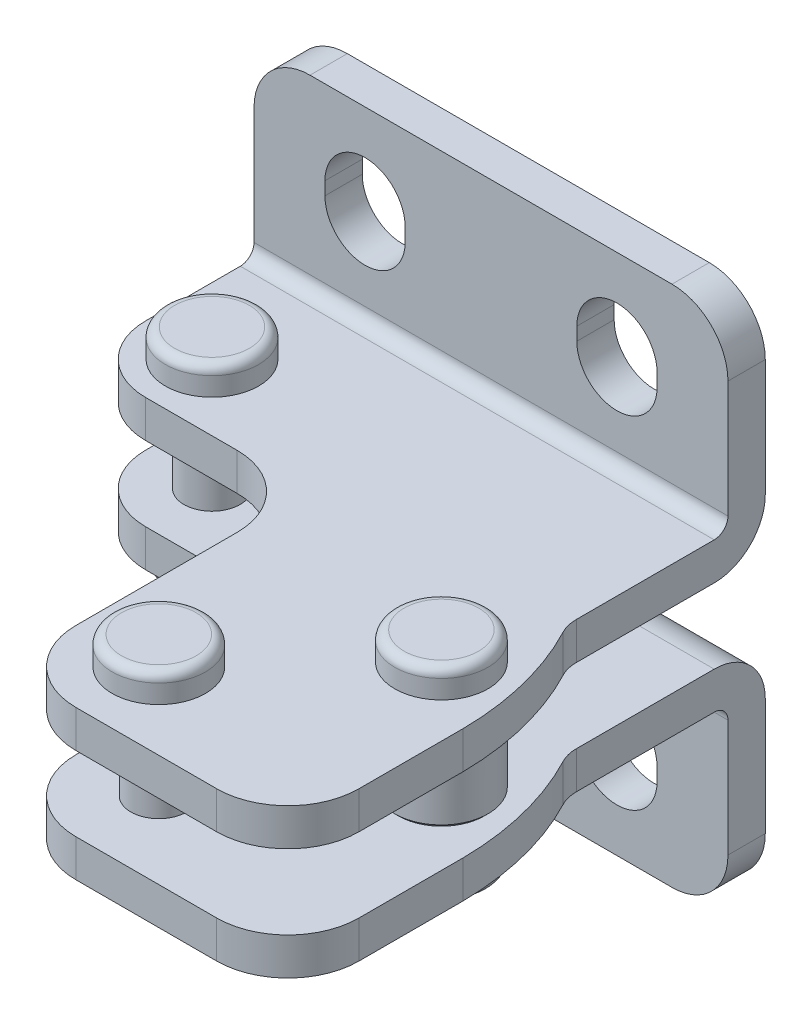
ISO-10303-21;
HEADER;
FILE_DESCRIPTION(('STEP AP214'),'2;1');
FILE_NAME('part.step','',(''),(''),'','','');
FILE_SCHEMA(('AUTOMOTIVE_DESIGN { 1 0 10303 214 1 1 1 1 }'));
ENDSEC;
DATA;
#1=APPLICATION_CONTEXT('core data for automotive mechanical design processes');
#2=APPLICATION_PROTOCOL_DEFINITION('international standard','automotive_design',2000,#1);
#3=PRODUCT_CONTEXT('',#1,'mechanical');
#4=PRODUCT('Part','Part','',(#3));
#5=PRODUCT_RELATED_PRODUCT_CATEGORY('part','',(#4));
#6=PRODUCT_DEFINITION_FORMATION('','',#4);
#7=PRODUCT_DEFINITION_CONTEXT('part definition',#1,'design');
#8=PRODUCT_DEFINITION('design','',#6,#7);
#9=PRODUCT_DEFINITION_SHAPE('','',#8);
#10=(LENGTH_UNIT() NAMED_UNIT(*) SI_UNIT(.MILLI.,.METRE.));
#11=(NAMED_UNIT(*) PLANE_ANGLE_UNIT() SI_UNIT($,.RADIAN.));
#12=(NAMED_UNIT(*) SI_UNIT($,.STERADIAN.) SOLID_ANGLE_UNIT());
#13=UNCERTAINTY_MEASURE_WITH_UNIT(LENGTH_MEASURE(1.E-05),#10,'distance_accuracy_value','');
#14=(GEOMETRIC_REPRESENTATION_CONTEXT(3) GLOBAL_UNCERTAINTY_ASSIGNED_CONTEXT((#13)) GLOBAL_UNIT_ASSIGNED_CONTEXT((#10,
#11,#12)) REPRESENTATION_CONTEXT('',''));
#15=CARTESIAN_POINT('',(0.,0.,0.));
#16=DIRECTION('',(0.,0.,1.));
#17=DIRECTION('',(1.,0.,0.));
#18=AXIS2_PLACEMENT_3D('',#15,#16,#17);
#19=CARTESIAN_POINT('',(2.50820551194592,7.49999999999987,15.1752778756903));
#20=DIRECTION('',(0.,-1.,0.));
#21=DIRECTION('',(0.99999918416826,0.,-0.00127736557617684));
#22=AXIS2_PLACEMENT_3D('',#19,#20,#21);
#23=PLANE('',#22);
#24=CARTESIAN_POINT('',(17.8061642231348,7.49999999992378,15.7149492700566));
#25=DIRECTION('',(0.,1.,0.));
#26=DIRECTION('',(0.00127736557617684,0.,0.99999918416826));
#27=AXIS2_PLACEMENT_3D('',#24,#25,#26);
#28=CIRCLE('',#27,2.29999999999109);
#29=CARTESIAN_POINT('',(17.8091021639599,7.49999999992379,18.0149473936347));
#30=VERTEX_POINT('',#29);
#31=EDGE_CURVE('E540',#30,#30,#28,.T.);
#32=ORIENTED_EDGE('',*,*,#31,.F.);
#33=EDGE_LOOP('',(#32));
#34=FACE_BOUND('',#33,.T.);
#35=CARTESIAN_POINT('',(-2.39399448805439,7.5000000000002,7.80927787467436));
#36=DIRECTION('',(0.,1.,0.));
#37=DIRECTION('',(-0.99999918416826,0.,0.00127736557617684));
#38=AXIS2_PLACEMENT_3D('',#35,#36,#37);
#39=CIRCLE('',#38,1.5);
#40=CARTESIAN_POINT('',(-3.89399326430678,7.50000000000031,7.81119392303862));
#41=VERTEX_POINT('',#40);
#42=EDGE_CURVE('E859',#41,#41,#39,.F.);
#43=ORIENTED_EDGE('',*,*,#42,.T.);
#44=EDGE_LOOP('',(#43));
#45=FACE_BOUND('',#44,.T.);
#46=CARTESIAN_POINT('',(10.4489304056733,7.49999999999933,23.5023527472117));
#47=DIRECTION('',(0.,-1.,0.));
#48=DIRECTION('',(0.99999918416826,0.,-0.00127736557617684));
#49=AXIS2_PLACEMENT_3D('',#46,#47,#48);
#50=CIRCLE('',#49,1.5);
#51=CARTESIAN_POINT('',(11.9489291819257,7.49999999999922,23.5004366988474));
#52=VERTEX_POINT('',#51);
#53=EDGE_CURVE('E652',#52,#52,#50,.F.);
#54=ORIENTED_EDGE('',*,*,#53,.F.);
#55=EDGE_LOOP('',(#54));
#56=FACE_BOUND('',#55,.T.);
#57=DIRECTION('',(1.02902278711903E-13,0.,1.));
#58=VECTOR('',#57,1.);
#59=CARTESIAN_POINT('',(-5.94999449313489,7.50000000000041,-6.25732245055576));
#60=LINE('',#59,#58);
#61=CARTESIAN_POINT('',(-5.94999449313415,7.50000000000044,2.73659999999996));
#62=VERTEX_POINT('',#61);
#63=CARTESIAN_POINT('',(-5.94999449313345,7.50000000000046,7.80927787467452));
#64=VERTEX_POINT('',#63);
#65=EDGE_CURVE('E964',#62,#64,#60,.T.);
#66=ORIENTED_EDGE('',*,*,#65,.T.);
#67=DIRECTION('',(0.00127736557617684,0.,0.99999918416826));
#68=VECTOR('',#67,1.);
#69=CARTESIAN_POINT('',(-5.94057452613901,7.50000000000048,15.1860700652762));
#70=LINE('',#69,#68);
#71=CARTESIAN_POINT('',(-5.94999159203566,7.50000000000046,7.81382018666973));
#72=VERTEX_POINT('',#71);
#73=EDGE_CURVE('E923',#72,#64,#70,.F.);
#74=ORIENTED_EDGE('',*,*,#73,.F.);
#75=CARTESIAN_POINT('',(-2.39399448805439,7.5000000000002,7.80927787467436));
#76=DIRECTION('',(0.,1.,0.));
#77=DIRECTION('',(-0.99999918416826,0.,0.00127736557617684));
#78=AXIS2_PLACEMENT_3D('',#75,#76,#77);
#79=CIRCLE('',#78,3.55600000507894);
#80=CARTESIAN_POINT('',(-2.39399448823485,7.50000000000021,11.3652778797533));
#81=VERTEX_POINT('',#80);
#82=EDGE_CURVE('E892',#81,#72,#79,.F.);
#83=ORIENTED_EDGE('',*,*,#82,.F.);
#84=DIRECTION('',(1.,0.,-1.41816463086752E-13));
#85=VECTOR('',#84,1.);
#86=CARTESIAN_POINT('',(2.50820551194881,7.49999999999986,11.3652778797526));
#87=LINE('',#86,#85);
#88=CARTESIAN_POINT('',(2.50820551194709,7.49999999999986,11.3652778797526));
#89=VERTEX_POINT('',#88);
#90=EDGE_CURVE('E893',#81,#89,#87,.T.);
#91=ORIENTED_EDGE('',*,*,#90,.T.);
#92=CARTESIAN_POINT('',(2.50820551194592,7.49999999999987,15.1752778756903));
#93=DIRECTION('',(0.,1.,0.));
#94=DIRECTION('',(-0.99999918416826,0.,0.00127736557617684));
#95=AXIS2_PLACEMENT_3D('',#92,#93,#94);
#96=CIRCLE('',#95,3.80999999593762);
#97=CARTESIAN_POINT('',(6.31820550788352,7.4999999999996,15.1752778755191));
#98=VERTEX_POINT('',#97);
#99=EDGE_CURVE('E896',#89,#98,#96,.F.);
#100=ORIENTED_EDGE('',*,*,#99,.T.);
#101=DIRECTION('',(0.,0.,1.));
#102=VECTOR('',#101,1.);
#103=CARTESIAN_POINT('',(6.31820550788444,7.49999999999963,23.8112778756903));
#104=LINE('',#103,#102);
#105=CARTESIAN_POINT('',(6.31820550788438,7.49999999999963,23.8112778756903));
#106=VERTEX_POINT('',#105);
#107=EDGE_CURVE('E899',#98,#106,#104,.T.);
#108=ORIENTED_EDGE('',*,*,#107,.T.);
#109=DIRECTION('',(0.00127736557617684,0.,0.99999918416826));
#110=VECTOR('',#109,1.);
#111=CARTESIAN_POINT('',(6.3071648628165,7.4999999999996,15.1704252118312));
#112=LINE('',#111,#110);
#113=CARTESIAN_POINT('',(6.31820861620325,7.49999999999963,23.8161446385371));
#114=VERTEX_POINT('',#113);
#115=EDGE_CURVE('E926',#114,#106,#112,.F.);
#116=ORIENTED_EDGE('',*,*,#115,.F.);
#117=CARTESIAN_POINT('',(10.1282055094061,7.49999999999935,23.8112778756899));
#118=DIRECTION('',(0.,1.,0.));
#119=DIRECTION('',(-0.99999918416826,0.,0.00127736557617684));
#120=AXIS2_PLACEMENT_3D('',#117,#118,#119);
#121=CIRCLE('',#120,3.81000000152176);
#122=CARTESIAN_POINT('',(10.1282055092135,7.49999999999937,27.6212778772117));
#123=VERTEX_POINT('',#122);
#124=EDGE_CURVE('E903',#123,#114,#121,.F.);
#125=ORIENTED_EDGE('',*,*,#124,.F.);
#126=DIRECTION('',(1.,0.,0.));
#127=VECTOR('',#126,1.);
#128=CARTESIAN_POINT('',(17.6720055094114,7.49999999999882,27.621277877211));
#129=LINE('',#128,#127);
#130=CARTESIAN_POINT('',(17.6720055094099,7.49999999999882,27.621277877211));
#131=VERTEX_POINT('',#130);
#132=EDGE_CURVE('E909',#123,#131,#129,.T.);
#133=ORIENTED_EDGE('',*,*,#132,.T.);
#134=CARTESIAN_POINT('',(17.672005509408,7.49999999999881,23.8112778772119));
#135=DIRECTION('',(0.,1.,0.));
#136=DIRECTION('',(-0.99999918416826,0.,0.00127736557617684));
#137=AXIS2_PLACEMENT_3D('',#134,#135,#136);
#138=CIRCLE('',#137,3.81000000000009);
#139=CARTESIAN_POINT('',(21.4820055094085,7.49999999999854,23.8112778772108));
#140=VERTEX_POINT('',#139);
#141=EDGE_CURVE('E915',#140,#131,#138,.F.);
#142=ORIENTED_EDGE('',*,*,#141,.F.);
#143=DIRECTION('',(-1.10366143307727E-13,0.,-1.));
#144=VECTOR('',#143,1.);
#145=CARTESIAN_POINT('',(21.4820055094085,7.49999999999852,18.2232778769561));
#146=LINE('',#145,#144);
#147=CARTESIAN_POINT('',(21.4820055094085,7.49999999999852,18.2232778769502));
#148=VERTEX_POINT('',#147);
#149=EDGE_CURVE('E918',#140,#148,#146,.T.);
#150=ORIENTED_EDGE('',*,*,#149,.T.);
#151=CARTESIAN_POINT('',(5.82283333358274,7.49999999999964,18.355140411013));
#152=DIRECTION('',(0.,1.,0.));
#153=DIRECTION('',(-0.99999918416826,0.,0.00127736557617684));
#154=AXIS2_PLACEMENT_3D('',#151,#152,#153);
#155=CIRCLE('',#154,15.6597273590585);
#156=CARTESIAN_POINT('',(19.6801867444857,7.49999999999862,11.0612513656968));
#157=VERTEX_POINT('',#156);
#158=EDGE_CURVE('E922',#157,#148,#155,.F.);
#159=ORIENTED_EDGE('',*,*,#158,.F.);
#160=CARTESIAN_POINT('',(21.4499944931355,7.49999999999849,10.1297039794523));
#161=DIRECTION('',(0.,1.,0.));
#162=DIRECTION('',(-0.99999918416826,0.,0.00127736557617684));
#163=AXIS2_PLACEMENT_3D('',#160,#161,#162);
#164=CIRCLE('',#163,2.);
#165=CARTESIAN_POINT('',(19.44999694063,7.49999999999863,10.1322587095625));
#166=VERTEX_POINT('',#165);
#167=EDGE_CURVE('E930',#166,#157,#164,.T.);
#168=ORIENTED_EDGE('',*,*,#167,.F.);
#169=DIRECTION('',(0.00127736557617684,0.,0.99999918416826));
#170=VECTOR('',#169,1.);
#171=CARTESIAN_POINT('',(19.4564118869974,7.49999999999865,15.1536288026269));
#172=LINE('',#171,#170);
#173=CARTESIAN_POINT('',(19.4499944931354,7.49999999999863,10.1297039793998));
#174=VERTEX_POINT('',#173);
#175=EDGE_CURVE('E933',#174,#166,#172,.T.);
#176=ORIENTED_EDGE('',*,*,#175,.F.);
#177=DIRECTION('',(0.,0.,-1.));
#178=VECTOR('',#177,1.);
#179=CARTESIAN_POINT('',(19.4499944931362,7.49999999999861,2.18323245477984));
#180=LINE('',#179,#178);
#181=CARTESIAN_POINT('',(19.449994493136,7.49999999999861,2.73659999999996));
#182=VERTEX_POINT('',#181);
#183=EDGE_CURVE('E948',#174,#182,#180,.T.);
#184=ORIENTED_EDGE('',*,*,#183,.T.);
#185=DIRECTION('',(1.,0.,0.));
#186=VECTOR('',#185,1.);
#187=CARTESIAN_POINT('',(-5.94999449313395,7.50000000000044,2.73659999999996));
#188=LINE('',#187,#186);
#189=EDGE_CURVE('E925',#62,#182,#188,.T.);
#190=ORIENTED_EDGE('',*,*,#189,.F.);
#191=EDGE_LOOP('',(#66,#74,#83,#91,#100,#108,#116,#125,#133,#142,#150,#159,#168,#176,#184,#190));
#192=FACE_BOUND('',#191,.T.);
#193=ADVANCED_FACE('F14',(#34,#45,#56,#192),#23,.F.);
#194=CARTESIAN_POINT('',(2.5082055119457,11.4999999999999,15.1752778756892));
#195=DIRECTION('',(0.,-1.,0.));
#196=DIRECTION('',(0.99999918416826,0.,-0.00127736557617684));
#197=AXIS2_PLACEMENT_3D('',#194,#195,#196);
#198=PLANE('',#197);
#199=CARTESIAN_POINT('',(17.806164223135,11.4999999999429,15.7149492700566));
#200=DIRECTION('',(0.,-1.,0.));
#201=DIRECTION('',(0.99999918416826,0.,-0.00127736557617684));
#202=AXIS2_PLACEMENT_3D('',#199,#200,#201);
#203=CIRCLE('',#202,2.29999999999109);
#204=CARTESIAN_POINT('',(20.1061623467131,11.4999999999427,15.7120113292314));
#205=VERTEX_POINT('',#204);
#206=EDGE_CURVE('E537',#205,#205,#203,.T.);
#207=ORIENTED_EDGE('',*,*,#206,.F.);
#208=EDGE_LOOP('',(#207));
#209=FACE_BOUND('',#208,.T.);
#210=CARTESIAN_POINT('',(-2.3939944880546,11.5000000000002,7.80927787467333));
#211=DIRECTION('',(0.,1.,0.));
#212=DIRECTION('',(-0.99999918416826,0.,0.00127736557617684));
#213=AXIS2_PLACEMENT_3D('',#210,#211,#212);
#214=CIRCLE('',#213,1.5);
#215=CARTESIAN_POINT('',(-3.89399326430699,11.5000000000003,7.8111939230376));
#216=VERTEX_POINT('',#215);
#217=EDGE_CURVE('E856',#216,#216,#214,.T.);
#218=ORIENTED_EDGE('',*,*,#217,.T.);
#219=EDGE_LOOP('',(#218));
#220=FACE_BOUND('',#219,.T.);
#221=CARTESIAN_POINT('',(10.4489304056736,11.4999999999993,23.5023527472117));
#222=DIRECTION('',(0.,-1.,0.));
#223=DIRECTION('',(0.99999918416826,0.,-0.00127736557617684));
#224=AXIS2_PLACEMENT_3D('',#221,#222,#223);
#225=CIRCLE('',#224,1.5);
#226=CARTESIAN_POINT('',(11.948929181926,11.4999999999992,23.5004366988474));
#227=VERTEX_POINT('',#226);
#228=EDGE_CURVE('E644',#227,#227,#225,.F.);
#229=ORIENTED_EDGE('',*,*,#228,.T.);
#230=EDGE_LOOP('',(#229));
#231=FACE_BOUND('',#230,.T.);
#232=DIRECTION('',(0.00127736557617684,0.,0.99999918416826));
#233=VECTOR('',#232,1.);
#234=CARTESIAN_POINT('',(-5.94057452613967,11.5000000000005,15.1860700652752));
#235=LINE('',#234,#233);
#236=CARTESIAN_POINT('',(-5.94999159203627,11.5000000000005,7.8138201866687));
#237=VERTEX_POINT('',#236);
#238=CARTESIAN_POINT('',(-5.94999449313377,11.5000000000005,7.80927787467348));
#239=VERTEX_POINT('',#238);
#240=EDGE_CURVE('E762',#237,#239,#235,.F.);
#241=ORIENTED_EDGE('',*,*,#240,.T.);
#242=DIRECTION('',(1.01720281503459E-13,0.,1.));
#243=VECTOR('',#242,1.);
#244=CARTESIAN_POINT('',(-5.94999449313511,11.5000000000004,-6.25732245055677));
#245=LINE('',#244,#243);
#246=CARTESIAN_POINT('',(-5.94999449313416,11.5000000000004,2.73659999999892));
#247=VERTEX_POINT('',#246);
#248=EDGE_CURVE('E797',#239,#247,#245,.F.);
#249=ORIENTED_EDGE('',*,*,#248,.T.);
#250=DIRECTION('',(1.,0.,0.));
#251=VECTOR('',#250,1.);
#252=CARTESIAN_POINT('',(-5.94999449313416,11.5000000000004,2.73659999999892));
#253=LINE('',#252,#251);
#254=CARTESIAN_POINT('',(19.449994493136,11.4999999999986,2.73659999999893));
#255=VERTEX_POINT('',#254);
#256=EDGE_CURVE('E773',#247,#255,#253,.T.);
#257=ORIENTED_EDGE('',*,*,#256,.T.);
#258=DIRECTION('',(0.,0.,-1.));
#259=VECTOR('',#258,1.);
#260=CARTESIAN_POINT('',(19.4499944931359,11.4999999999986,2.18323245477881));
#261=LINE('',#260,#259);
#262=CARTESIAN_POINT('',(19.4499944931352,11.4999999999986,10.12970397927));
#263=VERTEX_POINT('',#262);
#264=EDGE_CURVE('E785',#255,#263,#261,.F.);
#265=ORIENTED_EDGE('',*,*,#264,.T.);
#266=DIRECTION('',(0.00127736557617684,0.,0.99999918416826));
#267=VECTOR('',#266,1.);
#268=CARTESIAN_POINT('',(19.4564118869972,11.4999999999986,15.1536288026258));
#269=LINE('',#268,#267);
#270=CARTESIAN_POINT('',(19.4499969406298,11.4999999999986,10.1322587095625));
#271=VERTEX_POINT('',#270);
#272=EDGE_CURVE('E771',#263,#271,#269,.T.);
#273=ORIENTED_EDGE('',*,*,#272,.T.);
#274=CARTESIAN_POINT('',(21.4499944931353,11.4999999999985,10.1297039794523));
#275=DIRECTION('',(0.,1.,0.));
#276=DIRECTION('',(-0.99999918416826,0.,0.00127736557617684));
#277=AXIS2_PLACEMENT_3D('',#274,#275,#276);
#278=CIRCLE('',#277,2.);
#279=CARTESIAN_POINT('',(19.6801867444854,11.4999999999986,11.0612513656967));
#280=VERTEX_POINT('',#279);
#281=EDGE_CURVE('E768',#271,#280,#278,.T.);
#282=ORIENTED_EDGE('',*,*,#281,.T.);
#283=CARTESIAN_POINT('',(5.82283333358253,11.4999999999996,18.3551404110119));
#284=DIRECTION('',(0.,1.,0.));
#285=DIRECTION('',(-0.99999918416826,0.,0.00127736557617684));
#286=AXIS2_PLACEMENT_3D('',#283,#284,#285);
#287=CIRCLE('',#286,15.659727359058);
#288=CARTESIAN_POINT('',(21.4820055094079,11.4999999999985,18.2232778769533));
#289=VERTEX_POINT('',#288);
#290=EDGE_CURVE('E761',#289,#280,#287,.T.);
#291=ORIENTED_EDGE('',*,*,#290,.F.);
#292=DIRECTION('',(0.,0.,-1.));
#293=VECTOR('',#292,1.);
#294=CARTESIAN_POINT('',(21.4820055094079,11.4999999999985,18.2232778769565));
#295=LINE('',#294,#293);
#296=CARTESIAN_POINT('',(21.4820055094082,11.4999999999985,23.8112778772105));
#297=VERTEX_POINT('',#296);
#298=EDGE_CURVE('E757',#289,#297,#295,.F.);
#299=ORIENTED_EDGE('',*,*,#298,.T.);
#300=CARTESIAN_POINT('',(17.6720055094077,11.4999999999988,23.8112778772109));
#301=DIRECTION('',(0.,1.,0.));
#302=DIRECTION('',(-0.99999918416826,0.,0.00127736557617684));
#303=AXIS2_PLACEMENT_3D('',#300,#301,#302);
#304=CIRCLE('',#303,3.81000000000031);
#305=CARTESIAN_POINT('',(17.6720055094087,11.4999999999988,27.621277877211));
#306=VERTEX_POINT('',#305);
#307=EDGE_CURVE('E753',#306,#297,#304,.T.);
#308=ORIENTED_EDGE('',*,*,#307,.F.);
#309=DIRECTION('',(1.,0.,0.));
#310=VECTOR('',#309,1.);
#311=CARTESIAN_POINT('',(17.6720055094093,11.4999999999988,27.621277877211));
#312=LINE('',#311,#310);
#313=CARTESIAN_POINT('',(10.1282055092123,11.4999999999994,27.6212778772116));
#314=VERTEX_POINT('',#313);
#315=EDGE_CURVE('E750',#306,#314,#312,.F.);
#316=ORIENTED_EDGE('',*,*,#315,.T.);
#317=CARTESIAN_POINT('',(10.1282055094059,11.4999999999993,23.8112778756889));
#318=DIRECTION('',(0.,1.,0.));
#319=DIRECTION('',(-0.99999918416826,0.,0.00127736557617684));
#320=AXIS2_PLACEMENT_3D('',#317,#318,#319);
#321=CIRCLE('',#320,3.81000000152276);
#322=CARTESIAN_POINT('',(6.31820861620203,11.4999999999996,23.8161446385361));
#323=VERTEX_POINT('',#322);
#324=EDGE_CURVE('E746',#323,#314,#321,.T.);
#325=ORIENTED_EDGE('',*,*,#324,.F.);
#326=DIRECTION('',(0.00127736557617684,0.,0.99999918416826));
#327=VECTOR('',#326,1.);
#328=CARTESIAN_POINT('',(6.30716486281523,11.4999999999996,15.1704252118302));
#329=LINE('',#328,#327);
#330=CARTESIAN_POINT('',(6.31820550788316,11.4999999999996,23.8112778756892));
#331=VERTEX_POINT('',#330);
#332=EDGE_CURVE('E764',#323,#331,#329,.F.);
#333=ORIENTED_EDGE('',*,*,#332,.T.);
#334=DIRECTION('',(0.,0.,1.));
#335=VECTOR('',#334,1.);
#336=CARTESIAN_POINT('',(6.31820550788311,11.4999999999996,23.8112778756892));
#337=LINE('',#336,#335);
#338=CARTESIAN_POINT('',(6.31820550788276,11.4999999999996,15.1752778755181));
#339=VERTEX_POINT('',#338);
#340=EDGE_CURVE('E738',#331,#339,#337,.F.);
#341=ORIENTED_EDGE('',*,*,#340,.T.);
#342=CARTESIAN_POINT('',(2.5082055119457,11.4999999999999,15.1752778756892));
#343=DIRECTION('',(0.,1.,0.));
#344=DIRECTION('',(-0.99999918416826,0.,0.00127736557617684));
#345=AXIS2_PLACEMENT_3D('',#342,#343,#344);
#346=CIRCLE('',#345,3.80999999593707);
#347=CARTESIAN_POINT('',(2.50820551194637,11.4999999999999,11.3652778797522));
#348=VERTEX_POINT('',#347);
#349=EDGE_CURVE('E734',#339,#348,#346,.T.);
#350=ORIENTED_EDGE('',*,*,#349,.T.);
#351=DIRECTION('',(1.,0.,-1.05014304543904E-13));
#352=VECTOR('',#351,1.);
#353=CARTESIAN_POINT('',(2.50820551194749,11.4999999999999,11.3652778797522));
#354=LINE('',#353,#352);
#355=CARTESIAN_POINT('',(-2.39399448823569,11.5000000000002,11.3652778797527));
#356=VERTEX_POINT('',#355);
#357=EDGE_CURVE('E733',#348,#356,#354,.F.);
#358=ORIENTED_EDGE('',*,*,#357,.T.);
#359=CARTESIAN_POINT('',(-2.3939944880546,11.5000000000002,7.80927787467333));
#360=DIRECTION('',(0.,1.,0.));
#361=DIRECTION('',(-0.99999918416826,0.,0.00127736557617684));
#362=AXIS2_PLACEMENT_3D('',#359,#360,#361);
#363=CIRCLE('',#362,3.55600000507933);
#364=EDGE_CURVE('E729',#237,#356,#363,.T.);
#365=ORIENTED_EDGE('',*,*,#364,.F.);
#366=EDGE_LOOP('',(#241,#249,#257,#265,#273,#282,#291,#299,#308,#316,#325,#333,#341,#350,#358,#365));
#367=FACE_BOUND('',#366,.T.);
#368=ADVANCED_FACE('F1179',(#209,#220,#231,#367),#198,.T.);
#369=CARTESIAN_POINT('',(-2.39399448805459,5.5000000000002,7.80927787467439));
#370=DIRECTION('',(0.,1.,0.));
#371=DIRECTION('',(-0.99999918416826,0.,0.00127736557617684));
#372=AXIS2_PLACEMENT_3D('',#369,#370,#371);
#373=CYLINDRICAL_SURFACE('',#372,1.5);
#374=ORIENTED_EDGE('',*,*,#217,.F.);
#375=EDGE_LOOP('',(#374));
#376=FACE_BOUND('',#375,.T.);
#377=ORIENTED_EDGE('',*,*,#42,.F.);
#378=EDGE_LOOP('',(#377));
#379=FACE_BOUND('',#378,.T.);
#380=ADVANCED_FACE('F1314',(#376,#379),#373,.T.);
#381=CARTESIAN_POINT('',(10.4489304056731,5.49999999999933,23.5023527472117));
#382=DIRECTION('',(0.,1.,0.));
#383=DIRECTION('',(-0.99999918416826,0.,0.00127736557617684));
#384=AXIS2_PLACEMENT_3D('',#381,#382,#383);
#385=CYLINDRICAL_SURFACE('',#384,1.5);
#386=ORIENTED_EDGE('',*,*,#228,.F.);
#387=EDGE_LOOP('',(#386));
#388=FACE_BOUND('',#387,.T.);
#389=ORIENTED_EDGE('',*,*,#53,.T.);
#390=EDGE_LOOP('',(#389));
#391=FACE_BOUND('',#390,.T.);
#392=ADVANCED_FACE('F1273',(#388,#391),#385,.T.);
#393=CARTESIAN_POINT('',(-2.3939944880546,11.5000000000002,7.80927787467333));
#394=DIRECTION('',(0.,1.,0.));
#395=DIRECTION('',(-0.99999918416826,0.,0.00127736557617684));
#396=AXIS2_PLACEMENT_3D('',#393,#394,#395);
#397=CYLINDRICAL_SURFACE('',#396,3.55600000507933);
#398=DIRECTION('',(0.,1.,0.));
#399=VECTOR('',#398,1.);
#400=CARTESIAN_POINT('',(-2.39399448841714,11.5000000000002,11.3652778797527));
#401=LINE('',#400,#399);
#402=CARTESIAN_POINT('',(-2.39399448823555,13.5000000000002,11.3652778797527));
#403=VERTEX_POINT('',#402);
#404=EDGE_CURVE('E726',#356,#403,#401,.T.);
#405=ORIENTED_EDGE('',*,*,#404,.T.);
#406=CARTESIAN_POINT('',(-2.39399448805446,13.5000000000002,7.80927787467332));
#407=DIRECTION('',(0.,1.,0.));
#408=DIRECTION('',(-0.99999918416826,0.,0.00127736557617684));
#409=AXIS2_PLACEMENT_3D('',#406,#407,#408);
#410=CIRCLE('',#409,3.55600000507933);
#411=CARTESIAN_POINT('',(-5.94999449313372,13.5000000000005,7.80927787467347));
#412=VERTEX_POINT('',#411);
#413=EDGE_CURVE('E710',#403,#412,#410,.F.);
#414=ORIENTED_EDGE('',*,*,#413,.T.);
#415=DIRECTION('',(0.,-1.,0.));
#416=VECTOR('',#415,1.);
#417=CARTESIAN_POINT('',(-5.94999449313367,11.5000000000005,7.80927787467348));
#418=LINE('',#417,#416);
#419=EDGE_CURVE('E728',#412,#239,#418,.T.);
#420=ORIENTED_EDGE('',*,*,#419,.T.);
#421=ORIENTED_EDGE('',*,*,#240,.F.);
#422=ORIENTED_EDGE('',*,*,#364,.T.);
#423=EDGE_LOOP('',(#405,#414,#420,#421,#422));
#424=FACE_BOUND('',#423,.T.);
#425=ADVANCED_FACE('F1136',(#424),#397,.T.);
#426=CARTESIAN_POINT('',(-5.94999449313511,11.5000000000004,-6.25732245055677));
#427=DIRECTION('',(1.,0.,-1.01720498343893E-13));
#428=DIRECTION('',(1.01720281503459E-13,0.,1.));
#429=AXIS2_PLACEMENT_3D('',#426,#427,#428);
#430=PLANE('',#429);
#431=DIRECTION('',(0.,-1.,0.));
#432=VECTOR('',#431,1.);
#433=CARTESIAN_POINT('',(-5.94999449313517,-0.929922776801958,1.99999999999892));
#434=LINE('',#433,#432);
#435=CARTESIAN_POINT('',(-5.94999449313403,14.2366000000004,1.99999999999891));
#436=VERTEX_POINT('',#435);
#437=CARTESIAN_POINT('',(-5.94999449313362,20.5000000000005,1.99999999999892));
#438=VERTEX_POINT('',#437);
#439=EDGE_CURVE('E801',#436,#438,#434,.F.);
#440=ORIENTED_EDGE('',*,*,#439,.T.);
#441=DIRECTION('',(1.01720281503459E-13,0.,1.));
#442=VECTOR('',#441,1.);
#443=CARTESIAN_POINT('',(-5.94999449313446,20.5000000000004,-6.25732245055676));
#444=LINE('',#443,#442);
#445=CARTESIAN_POINT('',(-5.94999449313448,20.5000000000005,-1.10435478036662E-12));
#446=VERTEX_POINT('',#445);
#447=EDGE_CURVE('E1066',#438,#446,#444,.F.);
#448=ORIENTED_EDGE('',*,*,#447,.T.);
#449=DIRECTION('',(0.,-1.,0.));
#450=VECTOR('',#449,1.);
#451=CARTESIAN_POINT('',(-5.94999449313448,20.5026775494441,-1.10436406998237E-12));
#452=LINE('',#451,#450);
#453=CARTESIAN_POINT('',(-5.94999449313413,14.2366000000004,-1.08364576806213E-12));
#454=VERTEX_POINT('',#453);
#455=EDGE_CURVE('E836',#454,#446,#452,.F.);
#456=ORIENTED_EDGE('',*,*,#455,.F.);
#457=CARTESIAN_POINT('',(-5.94999449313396,14.2366000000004,2.73659999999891));
#458=DIRECTION('',(1.,0.,0.));
#459=DIRECTION('',(0.,0.,1.));
#460=AXIS2_PLACEMENT_3D('',#457,#458,#459);
#461=CIRCLE('',#460,2.7366);
#462=EDGE_CURVE('E804',#454,#247,#461,.F.);
#463=ORIENTED_EDGE('',*,*,#462,.T.);
#464=ORIENTED_EDGE('',*,*,#248,.F.);
#465=ORIENTED_EDGE('',*,*,#419,.F.);
#466=DIRECTION('',(0.,0.,-1.));
#467=VECTOR('',#466,1.);
#468=CARTESIAN_POINT('',(-5.94999449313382,13.5000000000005,7.80927787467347));
#469=LINE('',#468,#467);
#470=CARTESIAN_POINT('',(-5.94999449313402,13.5000000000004,2.73659999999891));
#471=VERTEX_POINT('',#470);
#472=EDGE_CURVE('E784',#412,#471,#469,.T.);
#473=ORIENTED_EDGE('',*,*,#472,.T.);
#474=CARTESIAN_POINT('',(-5.94999449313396,14.2366000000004,2.73659999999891));
#475=DIRECTION('',(1.,0.,0.));
#476=DIRECTION('',(0.,0.,1.));
#477=AXIS2_PLACEMENT_3D('',#474,#475,#476);
#478=CIRCLE('',#477,0.7366);
#479=EDGE_CURVE('E833',#471,#436,#478,.T.);
#480=ORIENTED_EDGE('',*,*,#479,.T.);
#481=EDGE_LOOP('',(#440,#448,#456,#463,#464,#465,#473,#480));
#482=FACE_BOUND('',#481,.T.);
#483=ADVANCED_FACE('F1133',(#482),#430,.F.);
#484=CARTESIAN_POINT('',(-18.8811255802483,14.2366000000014,2.73659999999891));
#485=DIRECTION('',(1.,0.,0.));
#486=DIRECTION('',(0.,0.,1.));
#487=AXIS2_PLACEMENT_3D('',#484,#485,#486);
#488=CYLINDRICAL_SURFACE('',#487,2.7366);
#489=DIRECTION('',(1.,0.,0.));
#490=VECTOR('',#489,1.);
#491=CARTESIAN_POINT('',(-18.8811255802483,14.2366000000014,-1.09245321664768E-12));
#492=LINE('',#491,#490);
#493=CARTESIAN_POINT('',(19.4499944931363,14.2365999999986,-1.05674569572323E-12));
#494=VERTEX_POINT('',#493);
#495=EDGE_CURVE('E830',#454,#494,#492,.T.);
#496=ORIENTED_EDGE('',*,*,#495,.T.);
#497=CARTESIAN_POINT('',(19.4499944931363,14.2365999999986,2.73659999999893));
#498=DIRECTION('',(1.,0.,0.));
#499=DIRECTION('',(0.,0.,1.));
#500=AXIS2_PLACEMENT_3D('',#497,#498,#499);
#501=CIRCLE('',#500,2.7366);
#502=EDGE_CURVE('E792',#255,#494,#501,.T.);
#503=ORIENTED_EDGE('',*,*,#502,.F.);
#504=ORIENTED_EDGE('',*,*,#256,.F.);
#505=ORIENTED_EDGE('',*,*,#462,.F.);
#506=EDGE_LOOP('',(#496,#503,#504,#505));
#507=FACE_BOUND('',#506,.T.);
#508=ADVANCED_FACE('F1110',(#507),#488,.T.);
#509=CARTESIAN_POINT('',(19.4499944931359,11.4999999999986,2.18323245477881));
#510=DIRECTION('',(-1.,0.,0.));
#511=DIRECTION('',(0.,0.,-1.));
#512=AXIS2_PLACEMENT_3D('',#509,#510,#511);
#513=PLANE('',#512);
#514=DIRECTION('',(-1.48803982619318E-13,-1.,0.));
#515=VECTOR('',#514,1.);
#516=CARTESIAN_POINT('',(19.4499944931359,12.0621226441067,-1.02808323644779E-12));
#517=LINE('',#516,#515);
#518=CARTESIAN_POINT('',(19.4499944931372,20.4999999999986,-1.05818809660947E-12));
#519=VERTEX_POINT('',#518);
#520=EDGE_CURVE('E834',#519,#494,#517,.T.);
#521=ORIENTED_EDGE('',*,*,#520,.F.);
#522=DIRECTION('',(0.,0.,1.));
#523=VECTOR('',#522,1.);
#524=CARTESIAN_POINT('',(19.4499944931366,20.4999999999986,2.18323245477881));
#525=LINE('',#524,#523);
#526=CARTESIAN_POINT('',(19.4499944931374,20.4999999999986,1.99999999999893));
#527=VERTEX_POINT('',#526);
#528=EDGE_CURVE('E533',#519,#527,#525,.T.);
#529=ORIENTED_EDGE('',*,*,#528,.T.);
#530=DIRECTION('',(0.,-1.,0.));
#531=VECTOR('',#530,1.);
#532=CARTESIAN_POINT('',(19.4499944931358,-0.929922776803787,1.99999999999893));
#533=LINE('',#532,#531);
#534=CARTESIAN_POINT('',(19.4499944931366,14.2365999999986,1.99999999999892));
#535=VERTEX_POINT('',#534);
#536=EDGE_CURVE('E798',#527,#535,#533,.T.);
#537=ORIENTED_EDGE('',*,*,#536,.T.);
#538=CARTESIAN_POINT('',(19.4499944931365,14.2365999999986,2.73659999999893));
#539=DIRECTION('',(1.,0.,0.));
#540=DIRECTION('',(0.,0.,1.));
#541=AXIS2_PLACEMENT_3D('',#538,#539,#540);
#542=CIRCLE('',#541,0.7366);
#543=CARTESIAN_POINT('',(19.4499944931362,13.4999999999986,2.73659999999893));
#544=VERTEX_POINT('',#543);
#545=EDGE_CURVE('E796',#535,#544,#542,.F.);
#546=ORIENTED_EDGE('',*,*,#545,.T.);
#547=DIRECTION('',(0.,0.,1.));
#548=VECTOR('',#547,1.);
#549=CARTESIAN_POINT('',(19.449994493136,13.4999999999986,2.73659999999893));
#550=LINE('',#549,#548);
#551=CARTESIAN_POINT('',(19.4499944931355,13.4999999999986,10.129703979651));
#552=VERTEX_POINT('',#551);
#553=EDGE_CURVE('E776',#544,#552,#550,.T.);
#554=ORIENTED_EDGE('',*,*,#553,.T.);
#555=DIRECTION('',(0.,-1.,0.));
#556=VECTOR('',#555,1.);
#557=CARTESIAN_POINT('',(19.4499944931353,11.4999999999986,10.1297039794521));
#558=LINE('',#557,#556);
#559=EDGE_CURVE('E788',#263,#552,#558,.F.);
#560=ORIENTED_EDGE('',*,*,#559,.F.);
#561=ORIENTED_EDGE('',*,*,#264,.F.);
#562=ORIENTED_EDGE('',*,*,#502,.T.);
#563=EDGE_LOOP('',(#521,#529,#537,#546,#554,#560,#561,#562));
#564=FACE_BOUND('',#563,.T.);
#565=ADVANCED_FACE('F1122',(#564),#513,.F.);
#566=CARTESIAN_POINT('',(21.4499944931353,11.4999999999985,10.1297039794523));
#567=DIRECTION('',(0.,1.,0.));
#568=DIRECTION('',(-0.99999918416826,0.,0.00127736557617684));
#569=AXIS2_PLACEMENT_3D('',#566,#567,#568);
#570=CYLINDRICAL_SURFACE('',#569,2.);
#571=ORIENTED_EDGE('',*,*,#272,.F.);
#572=ORIENTED_EDGE('',*,*,#559,.T.);
#573=CARTESIAN_POINT('',(21.4499944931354,13.4999999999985,10.1297039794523));
#574=DIRECTION('',(0.,1.,0.));
#575=DIRECTION('',(-0.99999918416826,0.,0.00127736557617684));
#576=AXIS2_PLACEMENT_3D('',#573,#574,#575);
#577=CIRCLE('',#576,2.);
#578=CARTESIAN_POINT('',(19.6801867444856,13.4999999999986,11.0612513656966));
#579=VERTEX_POINT('',#578);
#580=EDGE_CURVE('E800',#579,#552,#577,.F.);
#581=ORIENTED_EDGE('',*,*,#580,.F.);
#582=DIRECTION('',(0.,1.,0.));
#583=VECTOR('',#582,1.);
#584=CARTESIAN_POINT('',(19.6801867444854,11.4999999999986,11.0612513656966));
#585=LINE('',#584,#583);
#586=EDGE_CURVE('E758',#280,#579,#585,.T.);
#587=ORIENTED_EDGE('',*,*,#586,.F.);
#588=ORIENTED_EDGE('',*,*,#281,.F.);
#589=EDGE_LOOP('',(#571,#572,#581,#587,#588));
#590=FACE_BOUND('',#589,.T.);
#591=ADVANCED_FACE('F1109',(#590),#570,.F.);
#592=CARTESIAN_POINT('',(5.82283333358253,11.4999999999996,18.3551404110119));
#593=DIRECTION('',(0.,1.,0.));
#594=DIRECTION('',(-0.99999918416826,0.,0.00127736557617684));
#595=AXIS2_PLACEMENT_3D('',#592,#593,#594);
#596=CYLINDRICAL_SURFACE('',#595,15.659727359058);
#597=ORIENTED_EDGE('',*,*,#290,.T.);
#598=ORIENTED_EDGE('',*,*,#586,.T.);
#599=CARTESIAN_POINT('',(5.82283333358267,13.4999999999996,18.3551404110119));
#600=DIRECTION('',(0.,1.,0.));
#601=DIRECTION('',(-0.99999918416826,0.,0.00127736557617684));
#602=AXIS2_PLACEMENT_3D('',#599,#600,#601);
#603=CIRCLE('',#602,15.659727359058);
#604=CARTESIAN_POINT('',(21.482005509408,13.4999999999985,18.2232778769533));
#605=VERTEX_POINT('',#604);
#606=EDGE_CURVE('E725',#579,#605,#603,.F.);
#607=ORIENTED_EDGE('',*,*,#606,.T.);
#608=DIRECTION('',(0.,-1.,0.));
#609=VECTOR('',#608,1.);
#610=CARTESIAN_POINT('',(21.4820055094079,11.4999999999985,18.2232778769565));
#611=LINE('',#610,#609);
#612=EDGE_CURVE('E754',#605,#289,#611,.T.);
#613=ORIENTED_EDGE('',*,*,#612,.T.);
#614=EDGE_LOOP('',(#597,#598,#607,#613));
#615=FACE_BOUND('',#614,.T.);
#616=ADVANCED_FACE('F1171',(#615),#596,.T.);
#617=CARTESIAN_POINT('',(21.4820055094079,11.4999999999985,18.2232778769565));
#618=DIRECTION('',(-1.,0.,0.));
#619=DIRECTION('',(0.,0.,-1.));
#620=AXIS2_PLACEMENT_3D('',#617,#618,#619);
#621=PLANE('',#620);
#622=DIRECTION('',(0.,1.,0.));
#623=VECTOR('',#622,1.);
#624=CARTESIAN_POINT('',(21.4820055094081,11.4999999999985,23.8112778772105));
#625=LINE('',#624,#623);
#626=CARTESIAN_POINT('',(21.4820055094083,13.4999999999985,23.8112778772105));
#627=VERTEX_POINT('',#626);
#628=EDGE_CURVE('E751',#297,#627,#625,.T.);
#629=ORIENTED_EDGE('',*,*,#628,.F.);
#630=ORIENTED_EDGE('',*,*,#298,.F.);
#631=ORIENTED_EDGE('',*,*,#612,.F.);
#632=DIRECTION('',(0.,0.,1.));
#633=VECTOR('',#632,1.);
#634=CARTESIAN_POINT('',(21.482005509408,13.4999999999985,18.2232778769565));
#635=LINE('',#634,#633);
#636=EDGE_CURVE('E722',#605,#627,#635,.T.);
#637=ORIENTED_EDGE('',*,*,#636,.T.);
#638=EDGE_LOOP('',(#629,#630,#631,#637));
#639=FACE_BOUND('',#638,.T.);
#640=ADVANCED_FACE('F1168',(#639),#621,.F.);
#641=CARTESIAN_POINT('',(17.6720055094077,11.4999999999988,23.8112778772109));
#642=DIRECTION('',(0.,1.,0.));
#643=DIRECTION('',(-0.99999918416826,0.,0.00127736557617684));
#644=AXIS2_PLACEMENT_3D('',#641,#642,#643);
#645=CYLINDRICAL_SURFACE('',#644,3.81000000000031);
#646=ORIENTED_EDGE('',*,*,#307,.T.);
#647=ORIENTED_EDGE('',*,*,#628,.T.);
#648=CARTESIAN_POINT('',(17.6720055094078,13.4999999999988,23.8112778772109));
#649=DIRECTION('',(0.,1.,0.));
#650=DIRECTION('',(-0.99999918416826,0.,0.00127736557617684));
#651=AXIS2_PLACEMENT_3D('',#648,#649,#650);
#652=CIRCLE('',#651,3.81000000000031);
#653=CARTESIAN_POINT('',(17.6720055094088,13.4999999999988,27.6212778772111));
#654=VERTEX_POINT('',#653);
#655=EDGE_CURVE('E721',#627,#654,#652,.F.);
#656=ORIENTED_EDGE('',*,*,#655,.T.);
#657=DIRECTION('',(0.,-1.,0.));
#658=VECTOR('',#657,1.);
#659=CARTESIAN_POINT('',(17.6720055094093,11.4999999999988,27.621277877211));
#660=LINE('',#659,#658);
#661=EDGE_CURVE('E747',#654,#306,#660,.T.);
#662=ORIENTED_EDGE('',*,*,#661,.T.);
#663=EDGE_LOOP('',(#646,#647,#656,#662));
#664=FACE_BOUND('',#663,.T.);
#665=ADVANCED_FACE('F1163',(#664),#645,.T.);
#666=CARTESIAN_POINT('',(17.6720055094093,11.4999999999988,27.621277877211));
#667=DIRECTION('',(0.,0.,-1.));
#668=DIRECTION('',(1.,0.,0.));
#669=AXIS2_PLACEMENT_3D('',#666,#667,#668);
#670=PLANE('',#669);
#671=DIRECTION('',(0.,1.,0.));
#672=VECTOR('',#671,1.);
#673=CARTESIAN_POINT('',(10.1282055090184,11.4999999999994,27.6212778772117));
#674=LINE('',#673,#672);
#675=CARTESIAN_POINT('',(10.1282055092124,13.4999999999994,27.6212778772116));
#676=VERTEX_POINT('',#675);
#677=EDGE_CURVE('E742',#314,#676,#674,.T.);
#678=ORIENTED_EDGE('',*,*,#677,.F.);
#679=ORIENTED_EDGE('',*,*,#315,.F.);
#680=ORIENTED_EDGE('',*,*,#661,.F.);
#681=DIRECTION('',(-1.,0.,0.));
#682=VECTOR('',#681,1.);
#683=CARTESIAN_POINT('',(17.6720055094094,13.4999999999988,27.6212778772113));
#684=LINE('',#683,#682);
#685=EDGE_CURVE('E718',#654,#676,#684,.T.);
#686=ORIENTED_EDGE('',*,*,#685,.T.);
#687=EDGE_LOOP('',(#678,#679,#680,#686));
#688=FACE_BOUND('',#687,.T.);
#689=ADVANCED_FACE('F1160',(#688),#670,.F.);
#690=CARTESIAN_POINT('',(10.1282055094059,11.4999999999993,23.8112778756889));
#691=DIRECTION('',(0.,1.,0.));
#692=DIRECTION('',(-0.99999918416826,0.,0.00127736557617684));
#693=AXIS2_PLACEMENT_3D('',#690,#691,#692);
#694=CYLINDRICAL_SURFACE('',#693,3.81000000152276);
#695=ORIENTED_EDGE('',*,*,#677,.T.);
#696=CARTESIAN_POINT('',(10.128205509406,13.4999999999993,23.8112778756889));
#697=DIRECTION('',(0.,1.,0.));
#698=DIRECTION('',(-0.99999918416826,0.,0.00127736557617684));
#699=AXIS2_PLACEMENT_3D('',#696,#697,#698);
#700=CIRCLE('',#699,3.81000000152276);
#701=CARTESIAN_POINT('',(6.31820550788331,13.4999999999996,23.8112778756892));
#702=VERTEX_POINT('',#701);
#703=EDGE_CURVE('E715',#676,#702,#700,.F.);
#704=ORIENTED_EDGE('',*,*,#703,.T.);
#705=DIRECTION('',(0.,-1.,0.));
#706=VECTOR('',#705,1.);
#707=CARTESIAN_POINT('',(6.31820550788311,11.4999999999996,23.8112778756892));
#708=LINE('',#707,#706);
#709=EDGE_CURVE('E739',#702,#331,#708,.T.);
#710=ORIENTED_EDGE('',*,*,#709,.T.);
#711=ORIENTED_EDGE('',*,*,#332,.F.);
#712=ORIENTED_EDGE('',*,*,#324,.T.);
#713=EDGE_LOOP('',(#695,#704,#710,#711,#712));
#714=FACE_BOUND('',#713,.T.);
#715=ADVANCED_FACE('F1154',(#714),#694,.T.);
#716=CARTESIAN_POINT('',(6.31820550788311,11.4999999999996,23.8112778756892));
#717=DIRECTION('',(1.,0.,0.));
#718=DIRECTION('',(0.,0.,1.));
#719=AXIS2_PLACEMENT_3D('',#716,#717,#718);
#720=PLANE('',#719);
#721=DIRECTION('',(0.,1.,0.));
#722=VECTOR('',#721,1.);
#723=CARTESIAN_POINT('',(6.31820550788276,11.4999999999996,15.175277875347));
#724=LINE('',#723,#722);
#725=CARTESIAN_POINT('',(6.3182055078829,13.4999999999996,15.1752778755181));
#726=VERTEX_POINT('',#725);
#727=EDGE_CURVE('E735',#726,#339,#724,.F.);
#728=ORIENTED_EDGE('',*,*,#727,.T.);
#729=ORIENTED_EDGE('',*,*,#340,.F.);
#730=ORIENTED_EDGE('',*,*,#709,.F.);
#731=DIRECTION('',(0.,0.,-1.));
#732=VECTOR('',#731,1.);
#733=CARTESIAN_POINT('',(6.31820550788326,13.4999999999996,23.8112778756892));
#734=LINE('',#733,#732);
#735=EDGE_CURVE('E712',#702,#726,#734,.T.);
#736=ORIENTED_EDGE('',*,*,#735,.T.);
#737=EDGE_LOOP('',(#728,#729,#730,#736));
#738=FACE_BOUND('',#737,.T.);
#739=ADVANCED_FACE('F1151',(#738),#720,.F.);
#740=CARTESIAN_POINT('',(2.5082055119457,11.4999999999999,15.1752778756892));
#741=DIRECTION('',(0.,1.,0.));
#742=DIRECTION('',(-0.99999918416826,0.,0.00127736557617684));
#743=AXIS2_PLACEMENT_3D('',#740,#741,#742);
#744=CYLINDRICAL_SURFACE('',#743,3.80999999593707);
#745=DIRECTION('',(0.,-1.,0.));
#746=VECTOR('',#745,1.);
#747=CARTESIAN_POINT('',(2.50820551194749,11.4999999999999,11.3652778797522));
#748=LINE('',#747,#746);
#749=CARTESIAN_POINT('',(2.50820551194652,13.4999999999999,11.3652778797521));
#750=VERTEX_POINT('',#749);
#751=EDGE_CURVE('E730',#750,#348,#748,.T.);
#752=ORIENTED_EDGE('',*,*,#751,.T.);
#753=ORIENTED_EDGE('',*,*,#349,.F.);
#754=ORIENTED_EDGE('',*,*,#727,.F.);
#755=CARTESIAN_POINT('',(2.50820551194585,13.4999999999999,15.1752778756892));
#756=DIRECTION('',(0.,1.,0.));
#757=DIRECTION('',(-0.99999918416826,0.,0.00127736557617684));
#758=AXIS2_PLACEMENT_3D('',#755,#756,#757);
#759=CIRCLE('',#758,3.80999999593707);
#760=EDGE_CURVE('E711',#726,#750,#759,.T.);
#761=ORIENTED_EDGE('',*,*,#760,.T.);
#762=EDGE_LOOP('',(#752,#753,#754,#761));
#763=FACE_BOUND('',#762,.T.);
#764=ADVANCED_FACE('F1146',(#763),#744,.F.);
#765=CARTESIAN_POINT('',(2.50820551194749,11.4999999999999,11.3652778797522));
#766=DIRECTION('',(-1.0501408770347E-13,0.,-1.));
#767=DIRECTION('',(1.,0.,-1.05014304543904E-13));
#768=AXIS2_PLACEMENT_3D('',#765,#766,#767);
#769=PLANE('',#768);
#770=ORIENTED_EDGE('',*,*,#404,.F.);
#771=ORIENTED_EDGE('',*,*,#357,.F.);
#772=ORIENTED_EDGE('',*,*,#751,.F.);
#773=DIRECTION('',(-1.,0.,1.05014304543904E-13));
#774=VECTOR('',#773,1.);
#775=CARTESIAN_POINT('',(2.50820551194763,13.4999999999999,11.3652778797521));
#776=LINE('',#775,#774);
#777=EDGE_CURVE('E702',#750,#403,#776,.T.);
#778=ORIENTED_EDGE('',*,*,#777,.T.);
#779=EDGE_LOOP('',(#770,#771,#772,#778));
#780=FACE_BOUND('',#779,.T.);
#781=ADVANCED_FACE('F1142',(#780),#769,.F.);
#782=CARTESIAN_POINT('',(-5.94999449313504,5.50000000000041,-6.25732245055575));
#783=DIRECTION('',(1.,0.,-1.02902495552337E-13));
#784=DIRECTION('',(1.02902278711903E-13,0.,1.));
#785=AXIS2_PLACEMENT_3D('',#782,#783,#784);
#786=PLANE('',#785);
#787=DIRECTION('',(-1.74768231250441E-13,-1.,0.));
#788=VECTOR('',#787,1.);
#789=CARTESIAN_POINT('',(-5.94999449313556,-1.50267754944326,0.));
#790=LINE('',#789,#788);
#791=CARTESIAN_POINT('',(-5.94999449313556,-1.49999999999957,0.));
#792=VERTEX_POINT('',#791);
#793=CARTESIAN_POINT('',(-5.94999449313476,4.76340000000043,0.));
#794=VERTEX_POINT('',#793);
#795=EDGE_CURVE('E529',#792,#794,#790,.F.);
#796=ORIENTED_EDGE('',*,*,#795,.F.);
#797=DIRECTION('',(1.02902278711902E-13,0.,1.));
#798=VECTOR('',#797,1.);
#799=CARTESIAN_POINT('',(-5.94999449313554,-1.49999999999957,-6.25732245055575));
#800=LINE('',#799,#798);
#801=CARTESIAN_POINT('',(-5.94999449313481,-1.49999999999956,2.));
#802=VERTEX_POINT('',#801);
#803=EDGE_CURVE('E1063',#792,#802,#800,.T.);
#804=ORIENTED_EDGE('',*,*,#803,.T.);
#805=DIRECTION('',(0.,-1.,0.));
#806=VECTOR('',#805,1.);
#807=CARTESIAN_POINT('',(-5.94999449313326,19.9299227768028,1.99999999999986));
#808=LINE('',#807,#806);
#809=CARTESIAN_POINT('',(-5.94999449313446,4.76340000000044,1.99999999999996));
#810=VERTEX_POINT('',#809);
#811=EDGE_CURVE('E972',#810,#802,#808,.T.);
#812=ORIENTED_EDGE('',*,*,#811,.F.);
#813=CARTESIAN_POINT('',(-5.9499944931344,4.76340000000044,2.7366));
#814=DIRECTION('',(1.,0.,0.));
#815=DIRECTION('',(0.,0.,1.));
#816=AXIS2_PLACEMENT_3D('',#813,#814,#815);
#817=CIRCLE('',#816,0.7366);
#818=CARTESIAN_POINT('',(-5.94999449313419,5.50000000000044,2.7366));
#819=VERTEX_POINT('',#818);
#820=EDGE_CURVE('E995',#819,#810,#817,.F.);
#821=ORIENTED_EDGE('',*,*,#820,.F.);
#822=DIRECTION('',(-1.04016188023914E-13,0.,-1.));
#823=VECTOR('',#822,1.);
#824=CARTESIAN_POINT('',(-5.9499944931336,5.50000000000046,7.80927787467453));
#825=LINE('',#824,#823);
#826=CARTESIAN_POINT('',(-5.9499944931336,5.50000000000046,7.80927787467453));
#827=VERTEX_POINT('',#826);
#828=EDGE_CURVE('E962',#827,#819,#825,.T.);
#829=ORIENTED_EDGE('',*,*,#828,.F.);
#830=DIRECTION('',(0.,-1.,0.));
#831=VECTOR('',#830,1.);
#832=CARTESIAN_POINT('',(-5.9499944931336,5.50000000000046,7.80927787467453));
#833=LINE('',#832,#831);
#834=EDGE_CURVE('E985',#64,#827,#833,.T.);
#835=ORIENTED_EDGE('',*,*,#834,.F.);
#836=ORIENTED_EDGE('',*,*,#65,.F.);
#837=CARTESIAN_POINT('',(-5.94999449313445,4.76340000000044,2.7366));
#838=DIRECTION('',(1.,0.,0.));
#839=DIRECTION('',(0.,0.,1.));
#840=AXIS2_PLACEMENT_3D('',#837,#838,#839);
#841=CIRCLE('',#840,2.7366);
#842=EDGE_CURVE('E975',#794,#62,#841,.T.);
#843=ORIENTED_EDGE('',*,*,#842,.F.);
#844=EDGE_LOOP('',(#796,#804,#812,#821,#829,#835,#836,#843));
#845=FACE_BOUND('',#844,.T.);
#846=ADVANCED_FACE('F1241',(#845),#786,.F.);
#847=CARTESIAN_POINT('',(-2.39399448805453,5.5000000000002,7.80927787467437));
#848=DIRECTION('',(0.,1.,0.));
#849=DIRECTION('',(-0.99999918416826,0.,0.00127736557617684));
#850=AXIS2_PLACEMENT_3D('',#847,#848,#849);
#851=CYLINDRICAL_SURFACE('',#850,3.55600000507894);
#852=DIRECTION('',(0.,1.,0.));
#853=VECTOR('',#852,1.);
#854=CARTESIAN_POINT('',(-2.39399448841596,5.50000000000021,11.3652778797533));
#855=LINE('',#854,#853);
#856=CARTESIAN_POINT('',(-2.393994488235,5.50000000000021,11.3652778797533));
#857=VERTEX_POINT('',#856);
#858=EDGE_CURVE('E889',#857,#81,#855,.T.);
#859=ORIENTED_EDGE('',*,*,#858,.T.);
#860=ORIENTED_EDGE('',*,*,#82,.T.);
#861=ORIENTED_EDGE('',*,*,#73,.T.);
#862=ORIENTED_EDGE('',*,*,#834,.T.);
#863=CARTESIAN_POINT('',(-2.39399448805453,5.5000000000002,7.80927787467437));
#864=DIRECTION('',(0.,1.,0.));
#865=DIRECTION('',(-0.99999918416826,0.,0.00127736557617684));
#866=AXIS2_PLACEMENT_3D('',#863,#864,#865);
#867=CIRCLE('',#866,3.55600000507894);
#868=EDGE_CURVE('E842',#857,#827,#867,.F.);
#869=ORIENTED_EDGE('',*,*,#868,.F.);
#870=EDGE_LOOP('',(#859,#860,#861,#862,#869));
#871=FACE_BOUND('',#870,.T.);
#872=ADVANCED_FACE('F1319',(#871),#851,.T.);
#873=CARTESIAN_POINT('',(2.50820551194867,5.49999999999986,11.3652778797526));
#874=DIRECTION('',(-1.41816246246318E-13,0.,-1.));
#875=DIRECTION('',(1.,0.,-1.41816463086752E-13));
#876=AXIS2_PLACEMENT_3D('',#873,#874,#875);
#877=PLANE('',#876);
#878=ORIENTED_EDGE('',*,*,#858,.F.);
#879=DIRECTION('',(-1.,0.,1.41816463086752E-13));
#880=VECTOR('',#879,1.);
#881=CARTESIAN_POINT('',(2.50820551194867,5.49999999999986,11.3652778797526));
#882=LINE('',#881,#880);
#883=CARTESIAN_POINT('',(2.50820551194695,5.49999999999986,11.3652778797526));
#884=VERTEX_POINT('',#883);
#885=EDGE_CURVE('E871',#884,#857,#882,.T.);
#886=ORIENTED_EDGE('',*,*,#885,.F.);
#887=DIRECTION('',(0.,-1.,0.));
#888=VECTOR('',#887,1.);
#889=CARTESIAN_POINT('',(2.50820551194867,5.49999999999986,11.3652778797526));
#890=LINE('',#889,#888);
#891=EDGE_CURVE('E894',#89,#884,#890,.T.);
#892=ORIENTED_EDGE('',*,*,#891,.F.);
#893=ORIENTED_EDGE('',*,*,#90,.F.);
#894=EDGE_LOOP('',(#878,#886,#892,#893));
#895=FACE_BOUND('',#894,.T.);
#896=ADVANCED_FACE('F1322',(#895),#877,.F.);
#897=CARTESIAN_POINT('',(2.50820551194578,5.49999999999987,15.1752778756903));
#898=DIRECTION('',(0.,1.,0.));
#899=DIRECTION('',(-0.99999918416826,0.,0.00127736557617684));
#900=AXIS2_PLACEMENT_3D('',#897,#898,#899);
#901=CYLINDRICAL_SURFACE('',#900,3.80999999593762);
#902=ORIENTED_EDGE('',*,*,#891,.T.);
#903=CARTESIAN_POINT('',(2.50820551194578,5.49999999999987,15.1752778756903));
#904=DIRECTION('',(0.,1.,0.));
#905=DIRECTION('',(-0.99999918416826,0.,0.00127736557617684));
#906=AXIS2_PLACEMENT_3D('',#903,#904,#905);
#907=CIRCLE('',#906,3.80999999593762);
#908=CARTESIAN_POINT('',(6.31820550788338,5.4999999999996,15.1752778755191));
#909=VERTEX_POINT('',#908);
#910=EDGE_CURVE('E874',#909,#884,#907,.T.);
#911=ORIENTED_EDGE('',*,*,#910,.F.);
#912=DIRECTION('',(0.,1.,0.));
#913=VECTOR('',#912,1.);
#914=CARTESIAN_POINT('',(6.31820550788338,5.4999999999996,15.1752778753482));
#915=LINE('',#914,#913);
#916=EDGE_CURVE('E897',#98,#909,#915,.F.);
#917=ORIENTED_EDGE('',*,*,#916,.F.);
#918=ORIENTED_EDGE('',*,*,#99,.F.);
#919=EDGE_LOOP('',(#902,#911,#917,#918));
#920=FACE_BOUND('',#919,.T.);
#921=ADVANCED_FACE('F1326',(#920),#901,.F.);
#922=CARTESIAN_POINT('',(6.31820550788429,5.49999999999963,23.8112778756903));
#923=DIRECTION('',(1.,0.,0.));
#924=DIRECTION('',(0.,0.,1.));
#925=AXIS2_PLACEMENT_3D('',#922,#923,#924);
#926=PLANE('',#925);
#927=ORIENTED_EDGE('',*,*,#916,.T.);
#928=DIRECTION('',(0.,0.,-1.));
#929=VECTOR('',#928,1.);
#930=CARTESIAN_POINT('',(6.31820550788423,5.49999999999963,23.8112778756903));
#931=LINE('',#930,#929);
#932=CARTESIAN_POINT('',(6.31820550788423,5.49999999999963,23.8112778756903));
#933=VERTEX_POINT('',#932);
#934=EDGE_CURVE('E875',#933,#909,#931,.T.);
#935=ORIENTED_EDGE('',*,*,#934,.F.);
#936=DIRECTION('',(0.,-1.,0.));
#937=VECTOR('',#936,1.);
#938=CARTESIAN_POINT('',(6.31820550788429,5.49999999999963,23.8112778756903));
#939=LINE('',#938,#937);
#940=EDGE_CURVE('E900',#106,#933,#939,.T.);
#941=ORIENTED_EDGE('',*,*,#940,.F.);
#942=ORIENTED_EDGE('',*,*,#107,.F.);
#943=EDGE_LOOP('',(#927,#935,#941,#942));
#944=FACE_BOUND('',#943,.T.);
#945=ADVANCED_FACE('F1330',(#944),#926,.F.);
#946=CARTESIAN_POINT('',(10.1282055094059,5.49999999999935,23.8112778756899));
#947=DIRECTION('',(0.,1.,0.));
#948=DIRECTION('',(-0.99999918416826,0.,0.00127736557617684));
#949=AXIS2_PLACEMENT_3D('',#946,#947,#948);
#950=CYLINDRICAL_SURFACE('',#949,3.81000000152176);
#951=DIRECTION('',(0.,1.,0.));
#952=VECTOR('',#951,1.);
#953=CARTESIAN_POINT('',(10.1282055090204,5.49999999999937,27.6212778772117));
#954=LINE('',#953,#952);
#955=CARTESIAN_POINT('',(10.1282055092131,5.49999999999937,27.6212778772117));
#956=VERTEX_POINT('',#955);
#957=EDGE_CURVE('E906',#956,#123,#954,.T.);
#958=ORIENTED_EDGE('',*,*,#957,.T.);
#959=ORIENTED_EDGE('',*,*,#124,.T.);
#960=ORIENTED_EDGE('',*,*,#115,.T.);
#961=ORIENTED_EDGE('',*,*,#940,.T.);
#962=CARTESIAN_POINT('',(10.1282055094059,5.49999999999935,23.8112778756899));
#963=DIRECTION('',(0.,1.,0.));
#964=DIRECTION('',(-0.99999918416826,0.,0.00127736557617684));
#965=AXIS2_PLACEMENT_3D('',#962,#963,#964);
#966=CIRCLE('',#965,3.81000000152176);
#967=EDGE_CURVE('E878',#956,#933,#966,.F.);
#968=ORIENTED_EDGE('',*,*,#967,.F.);
#969=EDGE_LOOP('',(#958,#959,#960,#961,#968));
#970=FACE_BOUND('',#969,.T.);
#971=ADVANCED_FACE('F1334',(#970),#950,.T.);
#972=CARTESIAN_POINT('',(17.6720055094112,5.49999999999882,27.621277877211));
#973=DIRECTION('',(0.,0.,-1.));
#974=DIRECTION('',(1.,0.,0.));
#975=AXIS2_PLACEMENT_3D('',#972,#973,#974);
#976=PLANE('',#975);
#977=ORIENTED_EDGE('',*,*,#957,.F.);
#978=DIRECTION('',(-1.,0.,0.));
#979=VECTOR('',#978,1.);
#980=CARTESIAN_POINT('',(17.6720055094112,5.49999999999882,27.621277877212));
#981=LINE('',#980,#979);
#982=CARTESIAN_POINT('',(17.6720055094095,5.49999999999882,27.6212778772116));
#983=VERTEX_POINT('',#982);
#984=EDGE_CURVE('E881',#983,#956,#981,.T.);
#985=ORIENTED_EDGE('',*,*,#984,.F.);
#986=DIRECTION('',(0.,-1.,0.));
#987=VECTOR('',#986,1.);
#988=CARTESIAN_POINT('',(17.6720055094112,5.49999999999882,27.621277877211));
#989=LINE('',#988,#987);
#990=EDGE_CURVE('E910',#131,#983,#989,.T.);
#991=ORIENTED_EDGE('',*,*,#990,.F.);
#992=ORIENTED_EDGE('',*,*,#132,.F.);
#993=EDGE_LOOP('',(#977,#985,#991,#992));
#994=FACE_BOUND('',#993,.T.);
#995=ADVANCED_FACE('F1338',(#994),#976,.F.);
#996=CARTESIAN_POINT('',(17.6720055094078,5.49999999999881,23.811277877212));
#997=DIRECTION('',(0.,1.,0.));
#998=DIRECTION('',(-0.99999918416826,0.,0.00127736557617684));
#999=AXIS2_PLACEMENT_3D('',#996,#997,#998);
#1000=CYLINDRICAL_SURFACE('',#999,3.81000000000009);
#1001=CARTESIAN_POINT('',(17.6720055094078,5.49999999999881,23.811277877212));
#1002=DIRECTION('',(0.,1.,0.));
#1003=DIRECTION('',(-0.99999918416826,0.,0.00127736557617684));
#1004=AXIS2_PLACEMENT_3D('',#1001,#1002,#1003);
#1005=CIRCLE('',#1004,3.81000000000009);
#1006=CARTESIAN_POINT('',(21.4820055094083,5.49999999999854,23.8112778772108));
#1007=VERTEX_POINT('',#1006);
#1008=EDGE_CURVE('E884',#1007,#983,#1005,.F.);
#1009=ORIENTED_EDGE('',*,*,#1008,.F.);
#1010=DIRECTION('',(0.,1.,0.));
#1011=VECTOR('',#1010,1.);
#1012=CARTESIAN_POINT('',(21.4820055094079,5.49999999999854,23.8112778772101));
#1013=LINE('',#1012,#1011);
#1014=EDGE_CURVE('E912',#1007,#140,#1013,.T.);
#1015=ORIENTED_EDGE('',*,*,#1014,.T.);
#1016=ORIENTED_EDGE('',*,*,#141,.T.);
#1017=ORIENTED_EDGE('',*,*,#990,.T.);
#1018=EDGE_LOOP('',(#1009,#1015,#1016,#1017));
#1019=FACE_BOUND('',#1018,.T.);
#1020=ADVANCED_FACE('F1342',(#1019),#1000,.T.);
#1021=CARTESIAN_POINT('',(21.4820055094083,5.49999999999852,18.2232778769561));
#1022=DIRECTION('',(-1.,0.,1.10366360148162E-13));
#1023=DIRECTION('',(-1.10366143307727E-13,0.,-1.));
#1024=AXIS2_PLACEMENT_3D('',#1021,#1022,#1023);
#1025=PLANE('',#1024);
#1026=ORIENTED_EDGE('',*,*,#1014,.F.);
#1027=DIRECTION('',(1.00436152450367E-13,0.,1.));
#1028=VECTOR('',#1027,1.);
#1029=CARTESIAN_POINT('',(21.4820055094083,5.49999999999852,18.2232778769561));
#1030=LINE('',#1029,#1028);
#1031=CARTESIAN_POINT('',(21.4820055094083,5.49999999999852,18.2232778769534));
#1032=VERTEX_POINT('',#1031);
#1033=EDGE_CURVE('E885',#1032,#1007,#1030,.T.);
#1034=ORIENTED_EDGE('',*,*,#1033,.F.);
#1035=DIRECTION('',(0.,-1.,0.));
#1036=VECTOR('',#1035,1.);
#1037=CARTESIAN_POINT('',(21.4820055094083,5.49999999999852,18.2232778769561));
#1038=LINE('',#1037,#1036);
#1039=EDGE_CURVE('E916',#148,#1032,#1038,.T.);
#1040=ORIENTED_EDGE('',*,*,#1039,.F.);
#1041=ORIENTED_EDGE('',*,*,#149,.F.);
#1042=EDGE_LOOP('',(#1026,#1034,#1040,#1041));
#1043=FACE_BOUND('',#1042,.T.);
#1044=ADVANCED_FACE('F1346',(#1043),#1025,.F.);
#1045=CARTESIAN_POINT('',(5.8228333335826,5.49999999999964,18.355140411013));
#1046=DIRECTION('',(0.,1.,0.));
#1047=DIRECTION('',(-0.99999918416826,0.,0.00127736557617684));
#1048=AXIS2_PLACEMENT_3D('',#1045,#1046,#1047);
#1049=CYLINDRICAL_SURFACE('',#1048,15.6597273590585);
#1050=CARTESIAN_POINT('',(5.8228333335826,5.49999999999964,18.355140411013));
#1051=DIRECTION('',(0.,1.,0.));
#1052=DIRECTION('',(-0.99999918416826,0.,0.00127736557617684));
#1053=AXIS2_PLACEMENT_3D('',#1050,#1051,#1052);
#1054=CIRCLE('',#1053,15.6597273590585);
#1055=CARTESIAN_POINT('',(19.6801867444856,5.49999999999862,11.0612513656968));
#1056=VERTEX_POINT('',#1055);
#1057=EDGE_CURVE('E888',#1056,#1032,#1054,.F.);
#1058=ORIENTED_EDGE('',*,*,#1057,.F.);
#1059=DIRECTION('',(0.,1.,0.));
#1060=VECTOR('',#1059,1.);
#1061=CARTESIAN_POINT('',(19.6801867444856,5.49999999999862,11.0612513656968));
#1062=LINE('',#1061,#1060);
#1063=EDGE_CURVE('E919',#1056,#157,#1062,.T.);
#1064=ORIENTED_EDGE('',*,*,#1063,.T.);
#1065=ORIENTED_EDGE('',*,*,#158,.T.);
#1066=ORIENTED_EDGE('',*,*,#1039,.T.);
#1067=EDGE_LOOP('',(#1058,#1064,#1065,#1066));
#1068=FACE_BOUND('',#1067,.T.);
#1069=ADVANCED_FACE('F1350',(#1068),#1049,.T.);
#1070=CARTESIAN_POINT('',(21.4499944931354,5.49999999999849,10.1297039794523));
#1071=DIRECTION('',(0.,1.,0.));
#1072=DIRECTION('',(-0.99999918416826,0.,0.00127736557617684));
#1073=AXIS2_PLACEMENT_3D('',#1070,#1071,#1072);
#1074=CYLINDRICAL_SURFACE('',#1073,2.);
#1075=CARTESIAN_POINT('',(21.4499944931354,5.49999999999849,10.1297039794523));
#1076=DIRECTION('',(0.,1.,0.));
#1077=DIRECTION('',(-0.99999918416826,0.,0.00127736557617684));
#1078=AXIS2_PLACEMENT_3D('',#1075,#1076,#1077);
#1079=CIRCLE('',#1078,2.);
#1080=CARTESIAN_POINT('',(19.4499944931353,5.49999999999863,10.1297039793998));
#1081=VERTEX_POINT('',#1080);
#1082=EDGE_CURVE('E935',#1081,#1056,#1079,.T.);
#1083=ORIENTED_EDGE('',*,*,#1082,.F.);
#1084=DIRECTION('',(0.,-1.,0.));
#1085=VECTOR('',#1084,1.);
#1086=CARTESIAN_POINT('',(19.4499944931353,5.49999999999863,10.1297039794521));
#1087=LINE('',#1086,#1085);
#1088=EDGE_CURVE('E951',#1081,#174,#1087,.F.);
#1089=ORIENTED_EDGE('',*,*,#1088,.T.);
#1090=ORIENTED_EDGE('',*,*,#175,.T.);
#1091=ORIENTED_EDGE('',*,*,#167,.T.);
#1092=ORIENTED_EDGE('',*,*,#1063,.F.);
#1093=EDGE_LOOP('',(#1083,#1089,#1090,#1091,#1092));
#1094=FACE_BOUND('',#1093,.T.);
#1095=ADVANCED_FACE('F1354',(#1094),#1074,.F.);
#1096=CARTESIAN_POINT('',(19.449994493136,5.49999999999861,2.18323245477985));
#1097=DIRECTION('',(-1.,0.,0.));
#1098=DIRECTION('',(0.,0.,-1.));
#1099=AXIS2_PLACEMENT_3D('',#1096,#1097,#1098);
#1100=PLANE('',#1099);
#1101=DIRECTION('',(0.,-1.,0.));
#1102=VECTOR('',#1101,1.);
#1103=CARTESIAN_POINT('',(19.4499944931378,19.9299227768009,1.99999999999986));
#1104=LINE('',#1103,#1102);
#1105=CARTESIAN_POINT('',(19.4499944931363,-1.50000000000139,2.));
#1106=VERTEX_POINT('',#1105);
#1107=CARTESIAN_POINT('',(19.4499944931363,4.76339999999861,1.99999999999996));
#1108=VERTEX_POINT('',#1107);
#1109=EDGE_CURVE('E969',#1106,#1108,#1104,.F.);
#1110=ORIENTED_EDGE('',*,*,#1109,.F.);
#1111=DIRECTION('',(0.,0.,1.));
#1112=VECTOR('',#1111,1.);
#1113=CARTESIAN_POINT('',(19.4499944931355,-1.50000000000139,2.18323245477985));
#1114=LINE('',#1113,#1112);
#1115=CARTESIAN_POINT('',(19.4499944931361,-1.5000000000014,0.));
#1116=VERTEX_POINT('',#1115);
#1117=EDGE_CURVE('E1057',#1106,#1116,#1114,.F.);
#1118=ORIENTED_EDGE('',*,*,#1117,.T.);
#1119=DIRECTION('',(0.,-1.,0.));
#1120=VECTOR('',#1119,1.);
#1121=CARTESIAN_POINT('',(19.449994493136,6.93787735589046,0.));
#1122=LINE('',#1121,#1120);
#1123=CARTESIAN_POINT('',(19.449994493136,4.7633999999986,0.));
#1124=VERTEX_POINT('',#1123);
#1125=EDGE_CURVE('E996',#1124,#1116,#1122,.T.);
#1126=ORIENTED_EDGE('',*,*,#1125,.F.);
#1127=CARTESIAN_POINT('',(19.4499944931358,4.76339999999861,2.7366));
#1128=DIRECTION('',(1.,0.,0.));
#1129=DIRECTION('',(0.,0.,1.));
#1130=AXIS2_PLACEMENT_3D('',#1127,#1128,#1129);
#1131=CIRCLE('',#1130,2.7366);
#1132=EDGE_CURVE('E971',#182,#1124,#1131,.F.);
#1133=ORIENTED_EDGE('',*,*,#1132,.F.);
#1134=ORIENTED_EDGE('',*,*,#183,.F.);
#1135=ORIENTED_EDGE('',*,*,#1088,.F.);
#1136=DIRECTION('',(0.,0.,1.));
#1137=VECTOR('',#1136,1.);
#1138=CARTESIAN_POINT('',(19.4499944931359,5.49999999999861,2.73659999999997));
#1139=LINE('',#1138,#1137);
#1140=CARTESIAN_POINT('',(19.4499944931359,5.49999999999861,2.73659999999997));
#1141=VERTEX_POINT('',#1140);
#1142=EDGE_CURVE('E954',#1141,#1081,#1139,.T.);
#1143=ORIENTED_EDGE('',*,*,#1142,.F.);
#1144=CARTESIAN_POINT('',(19.4499944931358,4.76339999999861,2.7366));
#1145=DIRECTION('',(1.,0.,0.));
#1146=DIRECTION('',(0.,0.,1.));
#1147=AXIS2_PLACEMENT_3D('',#1144,#1145,#1146);
#1148=CIRCLE('',#1147,0.7366);
#1149=EDGE_CURVE('E978',#1141,#1108,#1148,.F.);
#1150=ORIENTED_EDGE('',*,*,#1149,.T.);
#1151=EDGE_LOOP('',(#1110,#1118,#1126,#1133,#1134,#1135,#1143,#1150));
#1152=FACE_BOUND('',#1151,.T.);
#1153=ADVANCED_FACE('F1240',(#1152),#1100,.F.);
#1154=CARTESIAN_POINT('',(-18.8811255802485,4.76340000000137,2.7366));
#1155=DIRECTION('',(1.,0.,0.));
#1156=DIRECTION('',(0.,0.,1.));
#1157=AXIS2_PLACEMENT_3D('',#1154,#1155,#1156);
#1158=CYLINDRICAL_SURFACE('',#1157,2.7366);
#1159=ORIENTED_EDGE('',*,*,#189,.T.);
#1160=ORIENTED_EDGE('',*,*,#1132,.T.);
#1161=DIRECTION('',(1.,0.,0.));
#1162=VECTOR('',#1161,1.);
#1163=CARTESIAN_POINT('',(-18.8811255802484,4.76340000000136,0.));
#1164=LINE('',#1163,#1162);
#1165=EDGE_CURVE('E992',#1124,#794,#1164,.F.);
#1166=ORIENTED_EDGE('',*,*,#1165,.T.);
#1167=ORIENTED_EDGE('',*,*,#842,.T.);
#1168=EDGE_LOOP('',(#1159,#1160,#1166,#1167));
#1169=FACE_BOUND('',#1168,.T.);
#1170=ADVANCED_FACE('F1312',(#1169),#1158,.T.);
#1171=CARTESIAN_POINT('',(2.50820551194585,13.4999999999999,15.1752778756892));
#1172=DIRECTION('',(0.,-1.,0.));
#1173=DIRECTION('',(0.99999918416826,0.,-0.00127736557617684));
#1174=AXIS2_PLACEMENT_3D('',#1171,#1172,#1173);
#1175=PLANE('',#1174);
#1176=CARTESIAN_POINT('',(17.8061642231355,13.4999999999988,15.7149492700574));
#1177=DIRECTION('',(0.,-1.,0.));
#1178=DIRECTION('',(-0.304666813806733,0.,-0.95245899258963));
#1179=AXIS2_PLACEMENT_3D('',#1176,#1177,#1178);
#1180=CIRCLE('',#1179,2.5);
#1181=CARTESIAN_POINT('',(17.0444971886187,13.4999999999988,13.3338017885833));
#1182=VERTEX_POINT('',#1181);
#1183=EDGE_CURVE('E543',#1182,#1182,#1180,.F.);
#1184=ORIENTED_EDGE('',*,*,#1183,.F.);
#1185=EDGE_LOOP('',(#1184));
#1186=FACE_BOUND('',#1185,.T.);
#1187=CARTESIAN_POINT('',(10.4489304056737,13.4999999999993,23.5023527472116));
#1188=DIRECTION('',(0.,-1.,0.));
#1189=DIRECTION('',(0.99999918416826,0.,-0.00127736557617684));
#1190=AXIS2_PLACEMENT_3D('',#1187,#1188,#1189);
#1191=CIRCLE('',#1190,2.5);
#1192=CARTESIAN_POINT('',(12.9489283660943,13.4999999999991,23.4991593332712));
#1193=VERTEX_POINT('',#1192);
#1194=EDGE_CURVE('E653',#1193,#1193,#1191,.F.);
#1195=ORIENTED_EDGE('',*,*,#1194,.F.);
#1196=EDGE_LOOP('',(#1195));
#1197=FACE_BOUND('',#1196,.T.);
#1198=CARTESIAN_POINT('',(-2.39399448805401,13.5000000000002,7.80927787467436));
#1199=DIRECTION('',(0.,-1.,0.));
#1200=DIRECTION('',(0.99999918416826,0.,-0.00127736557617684));
#1201=AXIS2_PLACEMENT_3D('',#1198,#1199,#1200);
#1202=CIRCLE('',#1201,2.5);
#1203=CARTESIAN_POINT('',(0.106003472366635,13.5,7.80608446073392));
#1204=VERTEX_POINT('',#1203);
#1205=EDGE_CURVE('E1018',#1204,#1204,#1202,.F.);
#1206=ORIENTED_EDGE('',*,*,#1205,.F.);
#1207=EDGE_LOOP('',(#1206));
#1208=FACE_BOUND('',#1207,.T.);
#1209=DIRECTION('',(1.,0.,0.));
#1210=VECTOR('',#1209,1.);
#1211=CARTESIAN_POINT('',(-5.94999449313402,13.5000000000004,2.73659999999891));
#1212=LINE('',#1211,#1210);
#1213=EDGE_CURVE('E779',#471,#544,#1212,.T.);
#1214=ORIENTED_EDGE('',*,*,#1213,.F.);
#1215=ORIENTED_EDGE('',*,*,#472,.F.);
#1216=ORIENTED_EDGE('',*,*,#413,.F.);
#1217=ORIENTED_EDGE('',*,*,#777,.F.);
#1218=ORIENTED_EDGE('',*,*,#760,.F.);
#1219=ORIENTED_EDGE('',*,*,#735,.F.);
#1220=ORIENTED_EDGE('',*,*,#703,.F.);
#1221=ORIENTED_EDGE('',*,*,#685,.F.);
#1222=ORIENTED_EDGE('',*,*,#655,.F.);
#1223=ORIENTED_EDGE('',*,*,#636,.F.);
#1224=ORIENTED_EDGE('',*,*,#606,.F.);
#1225=ORIENTED_EDGE('',*,*,#580,.T.);
#1226=ORIENTED_EDGE('',*,*,#553,.F.);
#1227=EDGE_LOOP('',(#1214,#1215,#1216,#1217,#1218,#1219,#1220,#1221,#1222,#1223,#1224,#1225,#1226));
#1228=FACE_BOUND('',#1227,.T.);
#1229=ADVANCED_FACE('F1129',(#1186,#1197,#1208,#1228),#1175,.F.);
#1230=CARTESIAN_POINT('',(-18.8811255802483,14.2366000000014,2.73659999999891));
#1231=DIRECTION('',(1.,0.,0.));
#1232=DIRECTION('',(0.,0.,1.));
#1233=AXIS2_PLACEMENT_3D('',#1230,#1231,#1232);
#1234=CYLINDRICAL_SURFACE('',#1233,0.7366);
#1235=ORIENTED_EDGE('',*,*,#545,.F.);
#1236=DIRECTION('',(1.,0.,0.));
#1237=VECTOR('',#1236,1.);
#1238=CARTESIAN_POINT('',(-18.8811255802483,14.2366000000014,1.9999999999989));
#1239=LINE('',#1238,#1237);
#1240=EDGE_CURVE('E793',#436,#535,#1239,.T.);
#1241=ORIENTED_EDGE('',*,*,#1240,.F.);
#1242=ORIENTED_EDGE('',*,*,#479,.F.);
#1243=ORIENTED_EDGE('',*,*,#1213,.T.);
#1244=EDGE_LOOP('',(#1235,#1241,#1242,#1243));
#1245=FACE_BOUND('',#1244,.T.);
#1246=ADVANCED_FACE('F1107',(#1245),#1234,.F.);
#1247=CARTESIAN_POINT('',(2.50820551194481,-0.929922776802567,1.99999999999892));
#1248=DIRECTION('',(0.,0.,-1.));
#1249=DIRECTION('',(1.,0.,0.));
#1250=AXIS2_PLACEMENT_3D('',#1247,#1248,#1249);
#1251=PLANE('',#1250);
#1252=DIRECTION('',(0.,-1.,0.));
#1253=VECTOR('',#1252,1.);
#1254=CARTESIAN_POINT('',(11.3500000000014,18.9999999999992,1.99999999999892));
#1255=LINE('',#1254,#1253);
#1256=CARTESIAN_POINT('',(11.3500000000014,18.9999999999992,1.99999999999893));
#1257=VERTEX_POINT('',#1256);
#1258=CARTESIAN_POINT('',(11.3500000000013,18.2999999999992,1.99999999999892));
#1259=VERTEX_POINT('',#1258);
#1260=EDGE_CURVE('E479',#1257,#1259,#1255,.T.);
#1261=ORIENTED_EDGE('',*,*,#1260,.F.);
#1262=CARTESIAN_POINT('',(13.5000000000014,18.999999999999,1.99999999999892));
#1263=DIRECTION('',(0.,0.,1.));
#1264=DIRECTION('',(-1.,0.,0.));
#1265=AXIS2_PLACEMENT_3D('',#1262,#1263,#1264);
#1266=CIRCLE('',#1265,2.15);
#1267=CARTESIAN_POINT('',(15.6500000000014,18.9999999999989,1.99999999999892));
#1268=VERTEX_POINT('',#1267);
#1269=EDGE_CURVE('E477',#1268,#1257,#1266,.T.);
#1270=ORIENTED_EDGE('',*,*,#1269,.F.);
#1271=DIRECTION('',(0.,1.,0.));
#1272=VECTOR('',#1271,1.);
#1273=CARTESIAN_POINT('',(15.6500000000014,18.9999999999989,1.99999999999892));
#1274=LINE('',#1273,#1272);
#1275=CARTESIAN_POINT('',(15.6500000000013,18.2999999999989,1.99999999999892));
#1276=VERTEX_POINT('',#1275);
#1277=EDGE_CURVE('E485',#1276,#1268,#1274,.T.);
#1278=ORIENTED_EDGE('',*,*,#1277,.F.);
#1279=CARTESIAN_POINT('',(13.5000000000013,18.299999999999,1.99999999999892));
#1280=DIRECTION('',(0.,0.,1.));
#1281=DIRECTION('',(-1.,0.,0.));
#1282=AXIS2_PLACEMENT_3D('',#1279,#1280,#1281);
#1283=CIRCLE('',#1282,2.15);
#1284=EDGE_CURVE('E482',#1259,#1276,#1283,.T.);
#1285=ORIENTED_EDGE('',*,*,#1284,.F.);
#1286=EDGE_LOOP('',(#1261,#1270,#1278,#1285));
#1287=FACE_BOUND('',#1286,.T.);
#1288=DIRECTION('',(0.,-1.,0.));
#1289=VECTOR('',#1288,1.);
#1290=CARTESIAN_POINT('',(-2.14999999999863,19.,1.99999999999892));
#1291=LINE('',#1290,#1289);
#1292=CARTESIAN_POINT('',(-2.14999999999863,19.,1.99999999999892));
#1293=VERTEX_POINT('',#1292);
#1294=CARTESIAN_POINT('',(-2.14999999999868,18.3,1.99999999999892));
#1295=VERTEX_POINT('',#1294);
#1296=EDGE_CURVE('E499',#1293,#1295,#1291,.T.);
#1297=ORIENTED_EDGE('',*,*,#1296,.F.);
#1298=CARTESIAN_POINT('',(1.37356497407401E-12,19.,1.99999999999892));
#1299=DIRECTION('',(0.,0.,1.));
#1300=DIRECTION('',(-1.,0.,0.));
#1301=AXIS2_PLACEMENT_3D('',#1298,#1299,#1300);
#1302=CIRCLE('',#1301,2.15);
#1303=CARTESIAN_POINT('',(2.15000000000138,19.,1.99999999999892));
#1304=VERTEX_POINT('',#1303);
#1305=EDGE_CURVE('E491',#1304,#1293,#1302,.T.);
#1306=ORIENTED_EDGE('',*,*,#1305,.F.);
#1307=DIRECTION('',(0.,1.,0.));
#1308=VECTOR('',#1307,1.);
#1309=CARTESIAN_POINT('',(2.15000000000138,19.,1.99999999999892));
#1310=LINE('',#1309,#1308);
#1311=CARTESIAN_POINT('',(2.15000000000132,18.3,1.99999999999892));
#1312=VERTEX_POINT('',#1311);
#1313=EDGE_CURVE('E505',#1312,#1304,#1310,.T.);
#1314=ORIENTED_EDGE('',*,*,#1313,.F.);
#1315=CARTESIAN_POINT('',(1.32141242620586E-12,18.3,1.99999999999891));
#1316=DIRECTION('',(0.,0.,1.));
#1317=DIRECTION('',(-1.,0.,0.));
#1318=AXIS2_PLACEMENT_3D('',#1315,#1316,#1317);
#1319=CIRCLE('',#1318,2.15);
#1320=EDGE_CURVE('E502',#1295,#1312,#1319,.T.);
#1321=ORIENTED_EDGE('',*,*,#1320,.F.);
#1322=EDGE_LOOP('',(#1297,#1306,#1314,#1321));
#1323=FACE_BOUND('',#1322,.T.);
#1324=ORIENTED_EDGE('',*,*,#536,.F.);
#1325=CARTESIAN_POINT('',(16.4499944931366,20.4999999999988,1.99999999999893));
#1326=DIRECTION('',(0.,0.,-1.));
#1327=DIRECTION('',(1.,0.,0.));
#1328=AXIS2_PLACEMENT_3D('',#1325,#1326,#1327);
#1329=CIRCLE('',#1328,3.);
#1330=CARTESIAN_POINT('',(16.4499944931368,23.4999999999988,1.99999999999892));
#1331=VERTEX_POINT('',#1330);
#1332=EDGE_CURVE('E1037',#527,#1331,#1329,.F.);
#1333=ORIENTED_EDGE('',*,*,#1332,.T.);
#1334=DIRECTION('',(1.,0.,0.));
#1335=VECTOR('',#1334,1.);
#1336=CARTESIAN_POINT('',(-5.94999449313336,23.5000000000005,1.99999999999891));
#1337=LINE('',#1336,#1335);
#1338=CARTESIAN_POINT('',(-2.9499944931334,23.5,1.99999999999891));
#1339=VERTEX_POINT('',#1338);
#1340=EDGE_CURVE('E523',#1339,#1331,#1337,.T.);
#1341=ORIENTED_EDGE('',*,*,#1340,.F.);
#1342=CARTESIAN_POINT('',(-2.94999449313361,20.5,1.99999999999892));
#1343=DIRECTION('',(0.,0.,-1.));
#1344=DIRECTION('',(1.,0.,0.));
#1345=AXIS2_PLACEMENT_3D('',#1342,#1343,#1344);
#1346=CIRCLE('',#1345,3.);
#1347=EDGE_CURVE('E1035',#1339,#438,#1346,.F.);
#1348=ORIENTED_EDGE('',*,*,#1347,.T.);
#1349=ORIENTED_EDGE('',*,*,#439,.F.);
#1350=ORIENTED_EDGE('',*,*,#1240,.T.);
#1351=EDGE_LOOP('',(#1324,#1333,#1341,#1348,#1349,#1350));
#1352=FACE_BOUND('',#1351,.T.);
#1353=ADVANCED_FACE('F1104',(#1287,#1323,#1352),#1251,.F.);
#1354=CARTESIAN_POINT('',(2.50820551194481,-0.929922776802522,-1.07846186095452E-12));
#1355=DIRECTION('',(0.,0.,-1.));
#1356=DIRECTION('',(1.,0.,0.));
#1357=AXIS2_PLACEMENT_3D('',#1354,#1355,#1356);
#1358=PLANE('',#1357);
#1359=CARTESIAN_POINT('',(13.5000000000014,18.999999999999,-1.07527444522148E-12));
#1360=DIRECTION('',(0.,0.,-1.));
#1361=DIRECTION('',(1.,0.,0.));
#1362=AXIS2_PLACEMENT_3D('',#1359,#1360,#1361);
#1363=CIRCLE('',#1362,2.15);
#1364=CARTESIAN_POINT('',(11.3500000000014,18.9999999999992,-1.07490513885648E-12));
#1365=VERTEX_POINT('',#1364);
#1366=CARTESIAN_POINT('',(15.6500000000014,18.9999999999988,-1.07564713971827E-12));
#1367=VERTEX_POINT('',#1366);
#1368=EDGE_CURVE('E9',#1365,#1367,#1363,.T.);
#1369=ORIENTED_EDGE('',*,*,#1368,.F.);
#1370=DIRECTION('',(0.,1.,0.));
#1371=VECTOR('',#1370,1.);
#1372=CARTESIAN_POINT('',(11.35,-0.929922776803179,-1.07508219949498E-12));
#1373=LINE('',#1372,#1371);
#1374=CARTESIAN_POINT('',(11.3500000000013,18.2999999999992,-1.07421633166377E-12));
#1375=VERTEX_POINT('',#1374);
#1376=EDGE_CURVE('E1077',#1375,#1365,#1373,.T.);
#1377=ORIENTED_EDGE('',*,*,#1376,.F.);
#1378=CARTESIAN_POINT('',(13.5000000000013,18.299999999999,-1.07454328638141E-12));
#1379=DIRECTION('',(0.,0.,-1.));
#1380=DIRECTION('',(1.,0.,0.));
#1381=AXIS2_PLACEMENT_3D('',#1378,#1379,#1380);
#1382=CIRCLE('',#1381,2.15);
#1383=CARTESIAN_POINT('',(15.6500000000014,18.2999999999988,-1.07666764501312E-12));
#1384=VERTEX_POINT('',#1383);
#1385=EDGE_CURVE('E1079',#1384,#1375,#1382,.T.);
#1386=ORIENTED_EDGE('',*,*,#1385,.F.);
#1387=DIRECTION('',(0.,-1.,0.));
#1388=VECTOR('',#1387,1.);
#1389=CARTESIAN_POINT('',(15.65,-0.929922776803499,-1.07408439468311E-12));
#1390=LINE('',#1389,#1388);
#1391=EDGE_CURVE('E22',#1367,#1384,#1390,.T.);
#1392=ORIENTED_EDGE('',*,*,#1391,.F.);
#1393=EDGE_LOOP('',(#1369,#1377,#1386,#1392));
#1394=FACE_BOUND('',#1393,.T.);
#1395=CARTESIAN_POINT('',(1.37393098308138E-12,19.,-1.08074076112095E-12));
#1396=DIRECTION('',(0.,0.,-1.));
#1397=DIRECTION('',(1.,0.,0.));
#1398=AXIS2_PLACEMENT_3D('',#1395,#1396,#1397);
#1399=CIRCLE('',#1398,2.15);
#1400=CARTESIAN_POINT('',(-2.14999999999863,19.,-1.08039602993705E-12));
#1401=VERTEX_POINT('',#1400);
#1402=CARTESIAN_POINT('',(2.15000000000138,19.,-1.07761522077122E-12));
#1403=VERTEX_POINT('',#1402);
#1404=EDGE_CURVE('E1075',#1401,#1403,#1399,.T.);
#1405=ORIENTED_EDGE('',*,*,#1404,.F.);
#1406=DIRECTION('',(0.,1.,0.));
#1407=VECTOR('',#1406,1.);
#1408=CARTESIAN_POINT('',(-2.15000000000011,-0.929922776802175,-1.08057605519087E-12));
#1409=LINE('',#1408,#1407);
#1410=CARTESIAN_POINT('',(-2.14999999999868,18.3,-1.07969621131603E-12));
#1411=VERTEX_POINT('',#1410);
#1412=EDGE_CURVE('E1068',#1411,#1401,#1409,.T.);
#1413=ORIENTED_EDGE('',*,*,#1412,.F.);
#1414=CARTESIAN_POINT('',(1.32178342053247E-12,18.3,-1.08004465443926E-12));
#1415=DIRECTION('',(0.,0.,-1.));
#1416=DIRECTION('',(1.,0.,0.));
#1417=AXIS2_PLACEMENT_3D('',#1414,#1415,#1416);
#1418=CIRCLE('',#1417,2.15);
#1419=CARTESIAN_POINT('',(2.15000000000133,18.3,-1.08212677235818E-12));
#1420=VERTEX_POINT('',#1419);
#1421=EDGE_CURVE('E1070',#1420,#1411,#1418,.T.);
#1422=ORIENTED_EDGE('',*,*,#1421,.F.);
#1423=DIRECTION('',(0.,-1.,0.));
#1424=VECTOR('',#1423,1.);
#1425=CARTESIAN_POINT('',(2.1499999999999,-0.929922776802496,-1.07780202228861E-12));
#1426=LINE('',#1425,#1424);
#1427=EDGE_CURVE('E1073',#1403,#1420,#1426,.T.);
#1428=ORIENTED_EDGE('',*,*,#1427,.F.);
#1429=EDGE_LOOP('',(#1405,#1413,#1422,#1428));
#1430=FACE_BOUND('',#1429,.T.);
#1431=DIRECTION('',(-1.,0.,0.));
#1432=VECTOR('',#1431,1.);
#1433=CARTESIAN_POINT('',(2.50820551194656,23.5,-1.07821492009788E-12));
#1434=LINE('',#1433,#1432);
#1435=CARTESIAN_POINT('',(16.449994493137,23.4999999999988,-1.0729569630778E-12));
#1436=VERTEX_POINT('',#1435);
#1437=CARTESIAN_POINT('',(-2.9499944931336,23.5,-1.08123120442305E-12));
#1438=VERTEX_POINT('',#1437);
#1439=EDGE_CURVE('E526',#1436,#1438,#1434,.T.);
#1440=ORIENTED_EDGE('',*,*,#1439,.F.);
#1441=CARTESIAN_POINT('',(16.4499944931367,20.4999999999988,-1.07295018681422E-12));
#1442=DIRECTION('',(0.,0.,-1.));
#1443=DIRECTION('',(1.,0.,0.));
#1444=AXIS2_PLACEMENT_3D('',#1441,#1442,#1443);
#1445=CIRCLE('',#1444,3.);
#1446=EDGE_CURVE('E1046',#1436,#519,#1445,.T.);
#1447=ORIENTED_EDGE('',*,*,#1446,.T.);
#1448=ORIENTED_EDGE('',*,*,#520,.T.);
#1449=ORIENTED_EDGE('',*,*,#495,.F.);
#1450=ORIENTED_EDGE('',*,*,#455,.T.);
#1451=CARTESIAN_POINT('',(-2.94999449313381,20.5,-1.07949309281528E-12));
#1452=DIRECTION('',(0.,0.,-1.));
#1453=DIRECTION('',(1.,0.,0.));
#1454=AXIS2_PLACEMENT_3D('',#1451,#1452,#1453);
#1455=CIRCLE('',#1454,3.);
#1456=EDGE_CURVE('E1044',#446,#1438,#1455,.T.);
#1457=ORIENTED_EDGE('',*,*,#1456,.T.);
#1458=EDGE_LOOP('',(#1440,#1447,#1448,#1449,#1450,#1457));
#1459=FACE_BOUND('',#1458,.T.);
#1460=ADVANCED_FACE('F1094',(#1394,#1430,#1459),#1358,.T.);
#1461=CARTESIAN_POINT('',(2.50820551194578,5.49999999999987,15.1752778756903));
#1462=DIRECTION('',(0.,-1.,0.));
#1463=DIRECTION('',(0.99999918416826,0.,-0.00127736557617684));
#1464=AXIS2_PLACEMENT_3D('',#1461,#1462,#1463);
#1465=PLANE('',#1464);
#1466=CARTESIAN_POINT('',(10.4489304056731,5.49999999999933,23.5023527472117));
#1467=DIRECTION('',(0.,1.,0.));
#1468=DIRECTION('',(-0.99999918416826,0.,0.00127736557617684));
#1469=AXIS2_PLACEMENT_3D('',#1466,#1467,#1468);
#1470=CIRCLE('',#1469,2.5);
#1471=CARTESIAN_POINT('',(7.94893244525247,5.49999999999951,23.5055461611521));
#1472=VERTEX_POINT('',#1471);
#1473=EDGE_CURVE('E600',#1472,#1472,#1470,.F.);
#1474=ORIENTED_EDGE('',*,*,#1473,.F.);
#1475=EDGE_LOOP('',(#1474));
#1476=FACE_BOUND('',#1475,.T.);
#1477=ORIENTED_EDGE('',*,*,#868,.T.);
#1478=ORIENTED_EDGE('',*,*,#828,.T.);
#1479=DIRECTION('',(1.,0.,0.));
#1480=VECTOR('',#1479,1.);
#1481=CARTESIAN_POINT('',(-5.94999449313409,5.50000000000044,2.7366));
#1482=LINE('',#1481,#1480);
#1483=EDGE_CURVE('E957',#819,#1141,#1482,.T.);
#1484=ORIENTED_EDGE('',*,*,#1483,.T.);
#1485=ORIENTED_EDGE('',*,*,#1142,.T.);
#1486=ORIENTED_EDGE('',*,*,#1082,.T.);
#1487=ORIENTED_EDGE('',*,*,#1057,.T.);
#1488=ORIENTED_EDGE('',*,*,#1033,.T.);
#1489=ORIENTED_EDGE('',*,*,#1008,.T.);
#1490=ORIENTED_EDGE('',*,*,#984,.T.);
#1491=ORIENTED_EDGE('',*,*,#967,.T.);
#1492=ORIENTED_EDGE('',*,*,#934,.T.);
#1493=ORIENTED_EDGE('',*,*,#910,.T.);
#1494=ORIENTED_EDGE('',*,*,#885,.T.);
#1495=EDGE_LOOP('',(#1477,#1478,#1484,#1485,#1486,#1487,#1488,#1489,#1490,#1491,#1492,#1493,#1494));
#1496=FACE_BOUND('',#1495,.T.);
#1497=CARTESIAN_POINT('',(-2.39399448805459,5.5000000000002,7.80927787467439));
#1498=DIRECTION('',(0.,1.,0.));
#1499=DIRECTION('',(-0.99999918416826,0.,0.00127736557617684));
#1500=AXIS2_PLACEMENT_3D('',#1497,#1498,#1499);
#1501=CIRCLE('',#1500,2.5);
#1502=CARTESIAN_POINT('',(-4.89399244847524,5.50000000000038,7.81247128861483));
#1503=VERTEX_POINT('',#1502);
#1504=EDGE_CURVE('E659',#1503,#1503,#1501,.F.);
#1505=ORIENTED_EDGE('',*,*,#1504,.F.);
#1506=EDGE_LOOP('',(#1505));
#1507=FACE_BOUND('',#1506,.T.);
#1508=CARTESIAN_POINT('',(17.806164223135,5.49999999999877,15.7149492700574));
#1509=DIRECTION('',(0.,1.,0.));
#1510=DIRECTION('',(0.304666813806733,0.,0.95245899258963));
#1511=AXIS2_PLACEMENT_3D('',#1508,#1509,#1510);
#1512=CIRCLE('',#1511,2.5);
#1513=CARTESIAN_POINT('',(18.5678312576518,5.49999999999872,18.0960967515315));
#1514=VERTEX_POINT('',#1513);
#1515=EDGE_CURVE('E547',#1514,#1514,#1512,.F.);
#1516=ORIENTED_EDGE('',*,*,#1515,.F.);
#1517=EDGE_LOOP('',(#1516));
#1518=FACE_BOUND('',#1517,.T.);
#1519=ADVANCED_FACE('F1258',(#1476,#1496,#1507,#1518),#1465,.T.);
#1520=CARTESIAN_POINT('',(2.50820551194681,19.9299227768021,-1.31453129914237E-13));
#1521=DIRECTION('',(0.,0.,1.));
#1522=DIRECTION('',(-1.,0.,0.));
#1523=AXIS2_PLACEMENT_3D('',#1520,#1521,#1522);
#1524=PLANE('',#1523);
#1525=DIRECTION('',(0.,1.,0.));
#1526=VECTOR('',#1525,1.);
#1527=CARTESIAN_POINT('',(15.6500000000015,19.9299227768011,-1.33428834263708E-13));
#1528=LINE('',#1527,#1526);
#1529=CARTESIAN_POINT('',(15.65,-1.12703753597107E-12,0.));
#1530=VERTEX_POINT('',#1529);
#1531=CARTESIAN_POINT('',(15.65,0.699999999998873,0.));
#1532=VERTEX_POINT('',#1531);
#1533=EDGE_CURVE('E439',#1530,#1532,#1528,.T.);
#1534=ORIENTED_EDGE('',*,*,#1533,.T.);
#1535=CARTESIAN_POINT('',(13.5,0.699999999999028,0.));
#1536=DIRECTION('',(0.,0.,1.));
#1537=DIRECTION('',(-1.,0.,0.));
#1538=AXIS2_PLACEMENT_3D('',#1535,#1536,#1537);
#1539=CIRCLE('',#1538,2.15);
#1540=CARTESIAN_POINT('',(11.35,0.699999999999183,0.));
#1541=VERTEX_POINT('',#1540);
#1542=EDGE_CURVE('E442',#1532,#1541,#1539,.T.);
#1543=ORIENTED_EDGE('',*,*,#1542,.T.);
#1544=DIRECTION('',(0.,-1.,0.));
#1545=VECTOR('',#1544,1.);
#1546=CARTESIAN_POINT('',(11.3500000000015,19.9299227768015,-1.32763066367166E-13));
#1547=LINE('',#1546,#1545);
#1548=CARTESIAN_POINT('',(11.35,-8.24311164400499E-13,0.));
#1549=VERTEX_POINT('',#1548);
#1550=EDGE_CURVE('E434',#1541,#1549,#1547,.T.);
#1551=ORIENTED_EDGE('',*,*,#1550,.T.);
#1552=CARTESIAN_POINT('',(13.5,-9.72204903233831E-13,0.));
#1553=DIRECTION('',(0.,0.,1.));
#1554=DIRECTION('',(-1.,0.,0.));
#1555=AXIS2_PLACEMENT_3D('',#1552,#1553,#1554);
#1556=CIRCLE('',#1555,2.15);
#1557=EDGE_CURVE('E414',#1549,#1530,#1556,.T.);
#1558=ORIENTED_EDGE('',*,*,#1557,.T.);
#1559=EDGE_LOOP('',(#1534,#1543,#1551,#1558));
#1560=FACE_BOUND('',#1559,.T.);
#1561=DIRECTION('',(0.,1.,0.));
#1562=VECTOR('',#1561,1.);
#1563=CARTESIAN_POINT('',(2.15000000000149,19.9299227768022,-1.32015983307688E-13));
#1564=LINE('',#1563,#1562);
#1565=CARTESIAN_POINT('',(2.15,-1.5483263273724E-13,0.));
#1566=VERTEX_POINT('',#1565);
#1567=CARTESIAN_POINT('',(2.15000000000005,0.699999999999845,0.));
#1568=VERTEX_POINT('',#1567);
#1569=EDGE_CURVE('E471',#1566,#1568,#1564,.T.);
#1570=ORIENTED_EDGE('',*,*,#1569,.T.);
#1571=CARTESIAN_POINT('',(0.,0.7,0.));
#1572=DIRECTION('',(0.,0.,1.));
#1573=DIRECTION('',(-1.,0.,0.));
#1574=AXIS2_PLACEMENT_3D('',#1571,#1572,#1573);
#1575=CIRCLE('',#1574,2.15);
#1576=CARTESIAN_POINT('',(-2.14999999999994,0.700000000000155,0.));
#1577=VERTEX_POINT('',#1576);
#1578=EDGE_CURVE('E474',#1568,#1577,#1575,.T.);
#1579=ORIENTED_EDGE('',*,*,#1578,.T.);
#1580=DIRECTION('',(0.,-1.,0.));
#1581=VECTOR('',#1580,1.);
#1582=CARTESIAN_POINT('',(-2.14999999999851,19.9299227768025,-1.31315910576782E-13));
#1583=LINE('',#1582,#1581);
#1584=CARTESIAN_POINT('',(-2.15,1.47893738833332E-13,0.));
#1585=VERTEX_POINT('',#1584);
#1586=EDGE_CURVE('E459',#1577,#1585,#1583,.T.);
#1587=ORIENTED_EDGE('',*,*,#1586,.T.);
#1588=CARTESIAN_POINT('',(0.,0.,0.));
#1589=DIRECTION('',(0.,0.,1.));
#1590=DIRECTION('',(-1.,0.,0.));
#1591=AXIS2_PLACEMENT_3D('',#1588,#1589,#1590);
#1592=CIRCLE('',#1591,2.15);
#1593=EDGE_CURVE('E468',#1585,#1566,#1592,.T.);
#1594=ORIENTED_EDGE('',*,*,#1593,.T.);
#1595=EDGE_LOOP('',(#1570,#1579,#1587,#1594));
#1596=FACE_BOUND('',#1595,.T.);
#1597=ORIENTED_EDGE('',*,*,#1125,.T.);
#1598=CARTESIAN_POINT('',(16.4499944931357,-1.50000000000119,0.));
#1599=DIRECTION('',(0.,0.,1.));
#1600=DIRECTION('',(-1.,0.,0.));
#1601=AXIS2_PLACEMENT_3D('',#1598,#1599,#1600);
#1602=CIRCLE('',#1601,3.);
#1603=CARTESIAN_POINT('',(16.4499944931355,-4.50000000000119,0.));
#1604=VERTEX_POINT('',#1603);
#1605=EDGE_CURVE('E1061',#1116,#1604,#1602,.F.);
#1606=ORIENTED_EDGE('',*,*,#1605,.T.);
#1607=DIRECTION('',(-1.,0.,0.));
#1608=VECTOR('',#1607,1.);
#1609=CARTESIAN_POINT('',(2.50820551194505,-4.50000000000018,0.));
#1610=LINE('',#1609,#1608);
#1611=CARTESIAN_POINT('',(-2.94999449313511,-4.49999999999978,0.));
#1612=VERTEX_POINT('',#1611);
#1613=EDGE_CURVE('E520',#1604,#1612,#1610,.T.);
#1614=ORIENTED_EDGE('',*,*,#1613,.T.);
#1615=CARTESIAN_POINT('',(-2.94999449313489,-1.49999999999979,0.));
#1616=DIRECTION('',(0.,0.,1.));
#1617=DIRECTION('',(-1.,0.,0.));
#1618=AXIS2_PLACEMENT_3D('',#1615,#1616,#1617);
#1619=CIRCLE('',#1618,3.);
#1620=EDGE_CURVE('E1059',#1612,#792,#1619,.F.);
#1621=ORIENTED_EDGE('',*,*,#1620,.T.);
#1622=ORIENTED_EDGE('',*,*,#795,.T.);
#1623=ORIENTED_EDGE('',*,*,#1165,.F.);
#1624=EDGE_LOOP('',(#1597,#1606,#1614,#1621,#1622,#1623));
#1625=FACE_BOUND('',#1624,.T.);
#1626=ADVANCED_FACE('F1303',(#1560,#1596,#1625),#1524,.F.);
#1627=CARTESIAN_POINT('',(2.50820551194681,19.9299227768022,1.99999999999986));
#1628=DIRECTION('',(0.,0.,1.));
#1629=DIRECTION('',(-1.,0.,0.));
#1630=AXIS2_PLACEMENT_3D('',#1627,#1628,#1629);
#1631=PLANE('',#1630);
#1632=CARTESIAN_POINT('',(13.5,0.699999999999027,1.99999999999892));
#1633=DIRECTION('',(0.,0.,1.));
#1634=DIRECTION('',(-1.,0.,0.));
#1635=AXIS2_PLACEMENT_3D('',#1632,#1633,#1634);
#1636=CIRCLE('',#1635,2.15);
#1637=CARTESIAN_POINT('',(15.65,0.699999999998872,1.99999999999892));
#1638=VERTEX_POINT('',#1637);
#1639=CARTESIAN_POINT('',(11.35,0.699999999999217,2.));
#1640=VERTEX_POINT('',#1639);
#1641=EDGE_CURVE('E37',#1638,#1640,#1636,.T.);
#1642=ORIENTED_EDGE('',*,*,#1641,.F.);
#1643=DIRECTION('',(0.,1.,0.));
#1644=VECTOR('',#1643,1.);
#1645=CARTESIAN_POINT('',(15.65,0.699999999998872,1.99999999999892));
#1646=LINE('',#1645,#1644);
#1647=CARTESIAN_POINT('',(15.65,-1.12703753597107E-12,1.99999999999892));
#1648=VERTEX_POINT('',#1647);
#1649=EDGE_CURVE('E427',#1648,#1638,#1646,.T.);
#1650=ORIENTED_EDGE('',*,*,#1649,.F.);
#1651=CARTESIAN_POINT('',(13.5,-9.72204903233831E-13,1.99999999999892));
#1652=DIRECTION('',(0.,0.,1.));
#1653=DIRECTION('',(-1.,0.,0.));
#1654=AXIS2_PLACEMENT_3D('',#1651,#1652,#1653);
#1655=CIRCLE('',#1654,2.15);
#1656=CARTESIAN_POINT('',(11.35,-8.17372270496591E-13,1.99999999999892));
#1657=VERTEX_POINT('',#1656);
#1658=EDGE_CURVE('E411',#1657,#1648,#1655,.T.);
#1659=ORIENTED_EDGE('',*,*,#1658,.F.);
#1660=DIRECTION('',(0.,-1.,0.));
#1661=VECTOR('',#1660,1.);
#1662=CARTESIAN_POINT('',(11.35,0.699999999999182,1.99999999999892));
#1663=LINE('',#1662,#1661);
#1664=EDGE_CURVE('E420',#1640,#1657,#1663,.T.);
#1665=ORIENTED_EDGE('',*,*,#1664,.F.);
#1666=EDGE_LOOP('',(#1642,#1650,#1659,#1665));
#1667=FACE_BOUND('',#1666,.T.);
#1668=CARTESIAN_POINT('',(0.,0.7,1.99999999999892));
#1669=DIRECTION('',(0.,0.,1.));
#1670=DIRECTION('',(-1.,0.,0.));
#1671=AXIS2_PLACEMENT_3D('',#1668,#1669,#1670);
#1672=CIRCLE('',#1671,2.15);
#1673=CARTESIAN_POINT('',(2.15000000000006,0.699999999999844,1.99999999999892));
#1674=VERTEX_POINT('',#1673);
#1675=CARTESIAN_POINT('',(-2.14999999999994,0.700000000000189,2.));
#1676=VERTEX_POINT('',#1675);
#1677=EDGE_CURVE('E445',#1674,#1676,#1672,.T.);
#1678=ORIENTED_EDGE('',*,*,#1677,.F.);
#1679=DIRECTION('',(0.,1.,0.));
#1680=VECTOR('',#1679,1.);
#1681=CARTESIAN_POINT('',(2.15000000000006,0.699999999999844,1.99999999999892));
#1682=LINE('',#1681,#1680);
#1683=CARTESIAN_POINT('',(2.15,-1.5483263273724E-13,1.99999999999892));
#1684=VERTEX_POINT('',#1683);
#1685=EDGE_CURVE('E453',#1684,#1674,#1682,.T.);
#1686=ORIENTED_EDGE('',*,*,#1685,.F.);
#1687=CARTESIAN_POINT('',(0.,0.,1.99999999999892));
#1688=DIRECTION('',(0.,0.,1.));
#1689=DIRECTION('',(-1.,0.,0.));
#1690=AXIS2_PLACEMENT_3D('',#1687,#1688,#1689);
#1691=CIRCLE('',#1690,2.15);
#1692=CARTESIAN_POINT('',(-2.15,1.54832632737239E-13,1.99999999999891));
#1693=VERTEX_POINT('',#1692);
#1694=EDGE_CURVE('E450',#1693,#1684,#1691,.T.);
#1695=ORIENTED_EDGE('',*,*,#1694,.F.);
#1696=DIRECTION('',(0.,-1.,0.));
#1697=VECTOR('',#1696,1.);
#1698=CARTESIAN_POINT('',(-2.14999999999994,0.700000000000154,1.99999999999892));
#1699=LINE('',#1698,#1697);
#1700=EDGE_CURVE('E447',#1676,#1693,#1699,.T.);
#1701=ORIENTED_EDGE('',*,*,#1700,.F.);
#1702=EDGE_LOOP('',(#1678,#1686,#1695,#1701));
#1703=FACE_BOUND('',#1702,.T.);
#1704=DIRECTION('',(-1.,0.,0.));
#1705=VECTOR('',#1704,1.);
#1706=CARTESIAN_POINT('',(-5.94999449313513,-4.49999999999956,1.99999999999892));
#1707=LINE('',#1706,#1705);
#1708=CARTESIAN_POINT('',(16.4499944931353,-4.50000000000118,1.99999999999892));
#1709=VERTEX_POINT('',#1708);
#1710=CARTESIAN_POINT('',(-2.94999449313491,-4.49999999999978,1.99999999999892));
#1711=VERTEX_POINT('',#1710);
#1712=EDGE_CURVE('E511',#1709,#1711,#1707,.T.);
#1713=ORIENTED_EDGE('',*,*,#1712,.F.);
#1714=CARTESIAN_POINT('',(16.4499944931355,-1.50000000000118,2.));
#1715=DIRECTION('',(0.,0.,1.));
#1716=DIRECTION('',(-1.,0.,0.));
#1717=AXIS2_PLACEMENT_3D('',#1714,#1715,#1716);
#1718=CIRCLE('',#1717,3.);
#1719=EDGE_CURVE('E1055',#1709,#1106,#1718,.T.);
#1720=ORIENTED_EDGE('',*,*,#1719,.T.);
#1721=ORIENTED_EDGE('',*,*,#1109,.T.);
#1722=DIRECTION('',(1.,0.,0.));
#1723=VECTOR('',#1722,1.);
#1724=CARTESIAN_POINT('',(-18.8811255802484,4.76340000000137,1.99999999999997));
#1725=LINE('',#1724,#1723);
#1726=EDGE_CURVE('E966',#1108,#810,#1725,.F.);
#1727=ORIENTED_EDGE('',*,*,#1726,.T.);
#1728=ORIENTED_EDGE('',*,*,#811,.T.);
#1729=CARTESIAN_POINT('',(-2.94999449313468,-1.49999999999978,2.));
#1730=DIRECTION('',(0.,0.,1.));
#1731=DIRECTION('',(-1.,0.,0.));
#1732=AXIS2_PLACEMENT_3D('',#1729,#1730,#1731);
#1733=CIRCLE('',#1732,3.);
#1734=EDGE_CURVE('E1053',#802,#1711,#1733,.T.);
#1735=ORIENTED_EDGE('',*,*,#1734,.T.);
#1736=EDGE_LOOP('',(#1713,#1720,#1721,#1727,#1728,#1735));
#1737=FACE_BOUND('',#1736,.T.);
#1738=ADVANCED_FACE('F424',(#1667,#1703,#1737),#1631,.T.);
#1739=CARTESIAN_POINT('',(-18.8811255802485,4.76340000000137,2.7366));
#1740=DIRECTION('',(1.,0.,0.));
#1741=DIRECTION('',(0.,0.,1.));
#1742=AXIS2_PLACEMENT_3D('',#1739,#1740,#1741);
#1743=CYLINDRICAL_SURFACE('',#1742,0.7366);
#1744=ORIENTED_EDGE('',*,*,#1149,.F.);
#1745=ORIENTED_EDGE('',*,*,#1483,.F.);
#1746=ORIENTED_EDGE('',*,*,#820,.T.);
#1747=ORIENTED_EDGE('',*,*,#1726,.F.);
#1748=EDGE_LOOP('',(#1744,#1745,#1746,#1747));
#1749=FACE_BOUND('',#1748,.T.);
#1750=ADVANCED_FACE('F1231',(#1749),#1743,.F.);
#1751=CARTESIAN_POINT('',(17.8061642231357,14.9999999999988,15.7149492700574));
#1752=DIRECTION('',(0.,-1.,0.));
#1753=DIRECTION('',(-0.304666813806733,0.,-0.95245899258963));
#1754=AXIS2_PLACEMENT_3D('',#1751,#1752,#1753);
#1755=CYLINDRICAL_SURFACE('',#1754,2.5);
#1756=CARTESIAN_POINT('',(17.8061642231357,14.4999999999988,15.7149492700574));
#1757=DIRECTION('',(0.,-1.,0.));
#1758=DIRECTION('',(-0.304666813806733,0.,-0.95245899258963));
#1759=AXIS2_PLACEMENT_3D('',#1756,#1757,#1758);
#1760=CIRCLE('',#1759,2.5);
#1761=CARTESIAN_POINT('',(17.0444971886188,14.4999999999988,13.3338017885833));
#1762=VERTEX_POINT('',#1761);
#1763=EDGE_CURVE('E544',#1762,#1762,#1760,.T.);
#1764=ORIENTED_EDGE('',*,*,#1763,.T.);
#1765=EDGE_LOOP('',(#1764));
#1766=FACE_BOUND('',#1765,.T.);
#1767=ORIENTED_EDGE('',*,*,#1183,.T.);
#1768=EDGE_LOOP('',(#1767));
#1769=FACE_BOUND('',#1768,.T.);
#1770=ADVANCED_FACE('F561',(#1766,#1769),#1755,.T.);
#1771=CARTESIAN_POINT('',(10.4489304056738,14.9999999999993,23.5023527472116));
#1772=DIRECTION('',(0.,-1.,0.));
#1773=DIRECTION('',(0.99999918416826,0.,-0.00127736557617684));
#1774=AXIS2_PLACEMENT_3D('',#1771,#1772,#1773);
#1775=CYLINDRICAL_SURFACE('',#1774,2.5);
#1776=CARTESIAN_POINT('',(10.4489304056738,14.4999999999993,23.5023527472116));
#1777=DIRECTION('',(0.,-1.,0.));
#1778=DIRECTION('',(0.99999918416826,0.,-0.00127736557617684));
#1779=AXIS2_PLACEMENT_3D('',#1776,#1777,#1778);
#1780=CIRCLE('',#1779,2.5);
#1781=CARTESIAN_POINT('',(12.9489283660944,14.4999999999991,23.4991593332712));
#1782=VERTEX_POINT('',#1781);
#1783=EDGE_CURVE('E592',#1782,#1782,#1780,.T.);
#1784=ORIENTED_EDGE('',*,*,#1783,.T.);
#1785=EDGE_LOOP('',(#1784));
#1786=FACE_BOUND('',#1785,.T.);
#1787=ORIENTED_EDGE('',*,*,#1194,.T.);
#1788=EDGE_LOOP('',(#1787));
#1789=FACE_BOUND('',#1788,.T.);
#1790=ADVANCED_FACE('F613',(#1786,#1789),#1775,.T.);
#1791=CARTESIAN_POINT('',(-2.39399448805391,15.,7.80927787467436));
#1792=DIRECTION('',(0.,-1.,0.));
#1793=DIRECTION('',(0.99999918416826,0.,-0.00127736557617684));
#1794=AXIS2_PLACEMENT_3D('',#1791,#1792,#1793);
#1795=CYLINDRICAL_SURFACE('',#1794,2.5);
#1796=CARTESIAN_POINT('',(-2.39399448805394,14.5000000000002,7.80927787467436));
#1797=DIRECTION('',(0.,-1.,0.));
#1798=DIRECTION('',(0.99999918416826,0.,-0.00127736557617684));
#1799=AXIS2_PLACEMENT_3D('',#1796,#1797,#1798);
#1800=CIRCLE('',#1799,2.5);
#1801=CARTESIAN_POINT('',(0.10600347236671,14.5,7.80608446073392));
#1802=VERTEX_POINT('',#1801);
#1803=EDGE_CURVE('E656',#1802,#1802,#1800,.T.);
#1804=ORIENTED_EDGE('',*,*,#1803,.T.);
#1805=EDGE_LOOP('',(#1804));
#1806=FACE_BOUND('',#1805,.T.);
#1807=ORIENTED_EDGE('',*,*,#1205,.T.);
#1808=EDGE_LOOP('',(#1807));
#1809=FACE_BOUND('',#1808,.T.);
#1810=ADVANCED_FACE('F670',(#1806,#1809),#1795,.T.);
#1811=CARTESIAN_POINT('',(10.448930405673,3.99999999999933,23.5023527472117));
#1812=DIRECTION('',(0.,1.,0.));
#1813=DIRECTION('',(-0.99999918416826,0.,0.00127736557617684));
#1814=AXIS2_PLACEMENT_3D('',#1811,#1812,#1813);
#1815=CYLINDRICAL_SURFACE('',#1814,2.5);
#1816=CARTESIAN_POINT('',(10.4489304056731,4.49999999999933,23.5023527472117));
#1817=DIRECTION('',(0.,1.,0.));
#1818=DIRECTION('',(-0.99999918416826,0.,0.00127736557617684));
#1819=AXIS2_PLACEMENT_3D('',#1816,#1817,#1818);
#1820=CIRCLE('',#1819,2.5);
#1821=CARTESIAN_POINT('',(7.94893244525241,4.49999999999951,23.5055461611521));
#1822=VERTEX_POINT('',#1821);
#1823=EDGE_CURVE('E601',#1822,#1822,#1820,.T.);
#1824=ORIENTED_EDGE('',*,*,#1823,.T.);
#1825=EDGE_LOOP('',(#1824));
#1826=FACE_BOUND('',#1825,.T.);
#1827=ORIENTED_EDGE('',*,*,#1473,.T.);
#1828=EDGE_LOOP('',(#1827));
#1829=FACE_BOUND('',#1828,.T.);
#1830=ADVANCED_FACE('F614',(#1826,#1829),#1815,.T.);
#1831=CARTESIAN_POINT('',(-2.3939944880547,4.0000000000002,7.80927787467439));
#1832=DIRECTION('',(0.,1.,0.));
#1833=DIRECTION('',(-0.99999918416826,0.,0.00127736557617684));
#1834=AXIS2_PLACEMENT_3D('',#1831,#1832,#1833);
#1835=CYLINDRICAL_SURFACE('',#1834,2.5);
#1836=CARTESIAN_POINT('',(-2.39399448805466,4.5000000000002,7.80927787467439));
#1837=DIRECTION('',(0.,1.,0.));
#1838=DIRECTION('',(-0.99999918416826,0.,0.00127736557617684));
#1839=AXIS2_PLACEMENT_3D('',#1836,#1837,#1838);
#1840=CIRCLE('',#1839,2.5);
#1841=CARTESIAN_POINT('',(-4.89399244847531,4.50000000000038,7.81247128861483));
#1842=VERTEX_POINT('',#1841);
#1843=EDGE_CURVE('E660',#1842,#1842,#1840,.T.);
#1844=ORIENTED_EDGE('',*,*,#1843,.T.);
#1845=EDGE_LOOP('',(#1844));
#1846=FACE_BOUND('',#1845,.T.);
#1847=ORIENTED_EDGE('',*,*,#1504,.T.);
#1848=EDGE_LOOP('',(#1847));
#1849=FACE_BOUND('',#1848,.T.);
#1850=ADVANCED_FACE('F672',(#1846,#1849),#1835,.T.);
#1851=CARTESIAN_POINT('',(17.8061642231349,3.99999999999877,15.7149492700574));
#1852=DIRECTION('',(0.,1.,0.));
#1853=DIRECTION('',(0.304666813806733,0.,0.95245899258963));
#1854=AXIS2_PLACEMENT_3D('',#1851,#1852,#1853);
#1855=CYLINDRICAL_SURFACE('',#1854,2.5);
#1856=CARTESIAN_POINT('',(17.8061642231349,4.49999999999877,15.7149492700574));
#1857=DIRECTION('',(0.,1.,0.));
#1858=DIRECTION('',(0.304666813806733,0.,0.95245899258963));
#1859=AXIS2_PLACEMENT_3D('',#1856,#1857,#1858);
#1860=CIRCLE('',#1859,2.5);
#1861=CARTESIAN_POINT('',(18.5678312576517,4.49999999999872,18.0960967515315));
#1862=VERTEX_POINT('',#1861);
#1863=EDGE_CURVE('E548',#1862,#1862,#1860,.T.);
#1864=ORIENTED_EDGE('',*,*,#1863,.T.);
#1865=EDGE_LOOP('',(#1864));
#1866=FACE_BOUND('',#1865,.T.);
#1867=ORIENTED_EDGE('',*,*,#1515,.T.);
#1868=EDGE_LOOP('',(#1867));
#1869=FACE_BOUND('',#1868,.T.);
#1870=ADVANCED_FACE('F559',(#1866,#1869),#1855,.T.);
#1871=CARTESIAN_POINT('',(17.8061642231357,14.4999999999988,15.7149492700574));
#1872=DIRECTION('',(0.,1.,0.));
#1873=DIRECTION('',(0.304666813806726,0.,0.952458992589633));
#1874=AXIS2_PLACEMENT_3D('',#1871,#1872,#1873);
#1875=TOROIDAL_SURFACE('',#1874,1.99999999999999,0.5);
#1876=ORIENTED_EDGE('',*,*,#1763,.F.);
#1877=EDGE_LOOP('',(#1876));
#1878=FACE_BOUND('',#1877,.T.);
#1879=CARTESIAN_POINT('',(17.8061642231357,14.9999999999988,15.7149492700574));
#1880=DIRECTION('',(0.,-1.,0.));
#1881=DIRECTION('',(0.304666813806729,0.,0.952458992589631));
#1882=AXIS2_PLACEMENT_3D('',#1879,#1880,#1881);
#1883=CIRCLE('',#1882,1.99999999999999);
#1884=CARTESIAN_POINT('',(18.4154978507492,14.9999999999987,17.6198672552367));
#1885=VERTEX_POINT('',#1884);
#1886=CARTESIAN_POINT('',(17.1968305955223,14.9999999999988,13.8100312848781));
#1887=VERTEX_POINT('',#1886);
#1888=EDGE_CURVE('E2167',#1885,#1887,#1883,.T.);
#1889=ORIENTED_EDGE('',*,*,#1888,.T.);
#1890=CARTESIAN_POINT('',(17.8061642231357,14.9999999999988,15.7149492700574));
#1891=DIRECTION('',(0.,-1.,0.));
#1892=DIRECTION('',(-0.304666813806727,0.,-0.952458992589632));
#1893=AXIS2_PLACEMENT_3D('',#1890,#1891,#1892);
#1894=CIRCLE('',#1893,1.99999999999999);
#1895=EDGE_CURVE('E2166',#1887,#1885,#1894,.T.);
#1896=ORIENTED_EDGE('',*,*,#1895,.T.);
#1897=EDGE_LOOP('',(#1889,#1896));
#1898=FACE_BOUND('',#1897,.T.);
#1899=ADVANCED_FACE('F553',(#1878,#1898),#1875,.T.);
#1900=CARTESIAN_POINT('',(10.4489304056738,14.4999999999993,23.5023527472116));
#1901=DIRECTION('',(0.,1.,0.));
#1902=DIRECTION('',(-0.99999918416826,0.,0.00127736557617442));
#1903=AXIS2_PLACEMENT_3D('',#1900,#1901,#1902);
#1904=TOROIDAL_SURFACE('',#1903,1.99999999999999,0.5);
#1905=ORIENTED_EDGE('',*,*,#1783,.F.);
#1906=EDGE_LOOP('',(#1905));
#1907=FACE_BOUND('',#1906,.T.);
#1908=CARTESIAN_POINT('',(10.4489304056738,14.9999999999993,23.5023527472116));
#1909=DIRECTION('',(0.,-1.,0.));
#1910=DIRECTION('',(-0.99999918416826,0.,0.00127736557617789));
#1911=AXIS2_PLACEMENT_3D('',#1908,#1909,#1910);
#1912=CIRCLE('',#1911,1.99999999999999);
#1913=CARTESIAN_POINT('',(8.4489320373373,14.9999999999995,23.504907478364));
#1914=VERTEX_POINT('',#1913);
#1915=CARTESIAN_POINT('',(12.4489287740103,14.9999999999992,23.4997980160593));
#1916=VERTEX_POINT('',#1915);
#1917=EDGE_CURVE('E2149',#1914,#1916,#1912,.T.);
#1918=ORIENTED_EDGE('',*,*,#1917,.T.);
#1919=CARTESIAN_POINT('',(10.4489304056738,14.9999999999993,23.5023527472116));
#1920=DIRECTION('',(0.,-1.,0.));
#1921=DIRECTION('',(0.99999918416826,0.,-0.00127736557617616));
#1922=AXIS2_PLACEMENT_3D('',#1919,#1920,#1921);
#1923=CIRCLE('',#1922,1.99999999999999);
#1924=EDGE_CURVE('E2095',#1916,#1914,#1923,.T.);
#1925=ORIENTED_EDGE('',*,*,#1924,.T.);
#1926=EDGE_LOOP('',(#1918,#1925));
#1927=FACE_BOUND('',#1926,.T.);
#1928=ADVANCED_FACE('F558',(#1907,#1927),#1904,.T.);
#1929=CARTESIAN_POINT('',(-2.39399448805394,14.5000000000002,7.80927787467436));
#1930=DIRECTION('',(0.,1.,0.));
#1931=DIRECTION('',(-0.99999918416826,0.,0.00127736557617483));
#1932=AXIS2_PLACEMENT_3D('',#1929,#1930,#1931);
#1933=TOROIDAL_SURFACE('',#1932,2.00000000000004,0.5);
#1934=ORIENTED_EDGE('',*,*,#1803,.F.);
#1935=EDGE_LOOP('',(#1934));
#1936=FACE_BOUND('',#1935,.T.);
#1937=CARTESIAN_POINT('',(-2.3939944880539,15.0000000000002,7.80927787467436));
#1938=DIRECTION('',(0.,-1.,0.));
#1939=DIRECTION('',(-0.99999918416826,0.,0.00127736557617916));
#1940=AXIS2_PLACEMENT_3D('',#1937,#1938,#1939);
#1941=CIRCLE('',#1940,2.00000000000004);
#1942=CARTESIAN_POINT('',(-4.39399285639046,15.0000000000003,7.81183260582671));
#1943=VERTEX_POINT('',#1942);
#1944=CARTESIAN_POINT('',(-0.393996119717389,15.,7.806723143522));
#1945=VERTEX_POINT('',#1944);
#1946=EDGE_CURVE('E1466',#1943,#1945,#1941,.T.);
#1947=ORIENTED_EDGE('',*,*,#1946,.T.);
#1948=CARTESIAN_POINT('',(-2.3939944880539,15.0000000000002,7.80927787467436));
#1949=DIRECTION('',(0.,-1.,0.));
#1950=DIRECTION('',(0.99999918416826,0.,-0.001277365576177));
#1951=AXIS2_PLACEMENT_3D('',#1948,#1949,#1950);
#1952=CIRCLE('',#1951,2.00000000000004);
#1953=EDGE_CURVE('E1465',#1945,#1943,#1952,.T.);
#1954=ORIENTED_EDGE('',*,*,#1953,.T.);
#1955=EDGE_LOOP('',(#1947,#1954));
#1956=FACE_BOUND('',#1955,.T.);
#1957=ADVANCED_FACE('F610',(#1936,#1956),#1933,.T.);
#1958=CARTESIAN_POINT('',(10.4489304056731,4.49999999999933,23.5023527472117));
#1959=DIRECTION('',(0.,-1.,0.));
#1960=DIRECTION('',(0.99999918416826,0.,-0.00127736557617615));
#1961=AXIS2_PLACEMENT_3D('',#1958,#1959,#1960);
#1962=TOROIDAL_SURFACE('',#1961,2.,0.5);
#1963=ORIENTED_EDGE('',*,*,#1823,.F.);
#1964=EDGE_LOOP('',(#1963));
#1965=FACE_BOUND('',#1964,.T.);
#1966=CARTESIAN_POINT('',(10.448930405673,3.99999999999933,23.5023527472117));
#1967=DIRECTION('',(0.,1.,0.));
#1968=DIRECTION('',(0.99999918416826,0.,-0.00127736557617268));
#1969=AXIS2_PLACEMENT_3D('',#1966,#1967,#1968);
#1970=CIRCLE('',#1969,2.);
#1971=CARTESIAN_POINT('',(12.4489287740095,3.99999999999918,23.4997980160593));
#1972=VERTEX_POINT('',#1971);
#1973=CARTESIAN_POINT('',(8.44893203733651,3.99999999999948,23.5049074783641));
#1974=VERTEX_POINT('',#1973);
#1975=EDGE_CURVE('E2092',#1972,#1974,#1970,.T.);
#1976=ORIENTED_EDGE('',*,*,#1975,.T.);
#1977=CARTESIAN_POINT('',(10.448930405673,3.99999999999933,23.5023527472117));
#1978=DIRECTION('',(0.,1.,0.));
#1979=DIRECTION('',(-0.99999918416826,0.,0.00127736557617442));
#1980=AXIS2_PLACEMENT_3D('',#1977,#1978,#1979);
#1981=CIRCLE('',#1980,2.);
#1982=EDGE_CURVE('E639',#1974,#1972,#1981,.T.);
#1983=ORIENTED_EDGE('',*,*,#1982,.T.);
#1984=EDGE_LOOP('',(#1976,#1983));
#1985=FACE_BOUND('',#1984,.T.);
#1986=ADVANCED_FACE('F616',(#1965,#1985),#1962,.T.);
#1987=CARTESIAN_POINT('',(-2.39399448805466,4.5000000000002,7.80927787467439));
#1988=DIRECTION('',(0.,-1.,0.));
#1989=DIRECTION('',(0.99999918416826,0.,-0.00127736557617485));
#1990=AXIS2_PLACEMENT_3D('',#1987,#1988,#1989);
#1991=TOROIDAL_SURFACE('',#1990,2.,0.5);
#1992=ORIENTED_EDGE('',*,*,#1843,.F.);
#1993=EDGE_LOOP('',(#1992));
#1994=FACE_BOUND('',#1993,.T.);
#1995=CARTESIAN_POINT('',(-2.3939944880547,4.0000000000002,7.80927787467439));
#1996=DIRECTION('',(0.,1.,0.));
#1997=DIRECTION('',(0.99999918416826,0.,-0.00127736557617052));
#1998=AXIS2_PLACEMENT_3D('',#1995,#1996,#1997);
#1999=CIRCLE('',#1998,2.);
#2000=CARTESIAN_POINT('',(-0.393996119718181,4.00000000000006,7.80672314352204));
#2001=VERTEX_POINT('',#2000);
#2002=CARTESIAN_POINT('',(-4.39399285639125,4.00000000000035,7.81183260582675));
#2003=VERTEX_POINT('',#2002);
#2004=EDGE_CURVE('E1443',#2001,#2003,#1999,.T.);
#2005=ORIENTED_EDGE('',*,*,#2004,.T.);
#2006=CARTESIAN_POINT('',(-2.3939944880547,4.0000000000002,7.80927787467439));
#2007=DIRECTION('',(0.,1.,0.));
#2008=DIRECTION('',(-0.99999918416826,0.,0.00127736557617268));
#2009=AXIS2_PLACEMENT_3D('',#2006,#2007,#2008);
#2010=CIRCLE('',#2009,2.);
#2011=EDGE_CURVE('E697',#2003,#2001,#2010,.T.);
#2012=ORIENTED_EDGE('',*,*,#2011,.T.);
#2013=EDGE_LOOP('',(#2005,#2012));
#2014=FACE_BOUND('',#2013,.T.);
#2015=ADVANCED_FACE('F674',(#1994,#2014),#1991,.T.);
#2016=CARTESIAN_POINT('',(17.8061642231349,4.49999999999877,15.7149492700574));
#2017=DIRECTION('',(0.,-1.,0.));
#2018=DIRECTION('',(-0.304666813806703,0.,-0.95245899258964));
#2019=AXIS2_PLACEMENT_3D('',#2016,#2017,#2018);
#2020=TOROIDAL_SURFACE('',#2019,1.99999999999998,0.5);
#2021=ORIENTED_EDGE('',*,*,#1863,.F.);
#2022=EDGE_LOOP('',(#2021));
#2023=FACE_BOUND('',#2022,.T.);
#2024=CARTESIAN_POINT('',(17.8061642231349,3.99999999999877,15.7149492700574));
#2025=DIRECTION('',(0.,1.,0.));
#2026=DIRECTION('',(-0.304666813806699,0.,-0.952458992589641));
#2027=AXIS2_PLACEMENT_3D('',#2024,#2025,#2026);
#2028=CIRCLE('',#2027,1.99999999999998);
#2029=CARTESIAN_POINT('',(17.1968305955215,3.99999999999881,13.8100312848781));
#2030=VERTEX_POINT('',#2029);
#2031=CARTESIAN_POINT('',(18.4154978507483,3.99999999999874,17.6198672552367));
#2032=VERTEX_POINT('',#2031);
#2033=EDGE_CURVE('E1289',#2030,#2032,#2028,.T.);
#2034=ORIENTED_EDGE('',*,*,#2033,.T.);
#2035=CARTESIAN_POINT('',(17.8061642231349,3.99999999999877,15.7149492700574));
#2036=DIRECTION('',(0.,1.,0.));
#2037=DIRECTION('',(0.304666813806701,0.,0.952458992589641));
#2038=AXIS2_PLACEMENT_3D('',#2035,#2036,#2037);
#2039=CIRCLE('',#2038,1.99999999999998);
#2040=EDGE_CURVE('E587',#2032,#2030,#2039,.T.);
#2041=ORIENTED_EDGE('',*,*,#2040,.T.);
#2042=EDGE_LOOP('',(#2034,#2041));
#2043=FACE_BOUND('',#2042,.T.);
#2044=ADVANCED_FACE('F564',(#2023,#2043),#2020,.T.);
#2045=CARTESIAN_POINT('',(17.8061642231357,14.9999999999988,15.7149492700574));
#2046=DIRECTION('',(0.,1.,0.));
#2047=DIRECTION('',(0.304666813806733,0.,0.95245899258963));
#2048=AXIS2_PLACEMENT_3D('',#2045,#2046,#2047);
#2049=PLANE('',#2048);
#2050=ORIENTED_EDGE('',*,*,#1895,.F.);
#2051=ORIENTED_EDGE('',*,*,#1888,.F.);
#2052=EDGE_LOOP('',(#2050,#2051));
#2053=FACE_BOUND('',#2052,.T.);
#2054=ADVANCED_FACE('F562',(#2053),#2049,.T.);
#2055=CARTESIAN_POINT('',(10.4489304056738,14.9999999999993,23.5023527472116));
#2056=DIRECTION('',(0.,1.,0.));
#2057=DIRECTION('',(-0.99999918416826,0.,0.00127736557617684));
#2058=AXIS2_PLACEMENT_3D('',#2055,#2056,#2057);
#2059=PLANE('',#2058);
#2060=ORIENTED_EDGE('',*,*,#1924,.F.);
#2061=ORIENTED_EDGE('',*,*,#1917,.F.);
#2062=EDGE_LOOP('',(#2060,#2061));
#2063=FACE_BOUND('',#2062,.T.);
#2064=ADVANCED_FACE('F612',(#2063),#2059,.T.);
#2065=CARTESIAN_POINT('',(-2.39399448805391,15.,7.80927787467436));
#2066=DIRECTION('',(0.,1.,0.));
#2067=DIRECTION('',(-0.99999918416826,0.,0.00127736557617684));
#2068=AXIS2_PLACEMENT_3D('',#2065,#2066,#2067);
#2069=PLANE('',#2068);
#2070=ORIENTED_EDGE('',*,*,#1953,.F.);
#2071=ORIENTED_EDGE('',*,*,#1946,.F.);
#2072=EDGE_LOOP('',(#2070,#2071));
#2073=FACE_BOUND('',#2072,.T.);
#2074=ADVANCED_FACE('F671',(#2073),#2069,.T.);
#2075=CARTESIAN_POINT('',(10.448930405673,3.99999999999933,23.5023527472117));
#2076=DIRECTION('',(0.,-1.,0.));
#2077=DIRECTION('',(0.99999918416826,0.,-0.00127736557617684));
#2078=AXIS2_PLACEMENT_3D('',#2075,#2076,#2077);
#2079=PLANE('',#2078);
#2080=ORIENTED_EDGE('',*,*,#1982,.F.);
#2081=ORIENTED_EDGE('',*,*,#1975,.F.);
#2082=EDGE_LOOP('',(#2080,#2081));
#2083=FACE_BOUND('',#2082,.T.);
#2084=ADVANCED_FACE('F1229',(#2083),#2079,.T.);
#2085=CARTESIAN_POINT('',(-2.3939944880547,4.0000000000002,7.80927787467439));
#2086=DIRECTION('',(0.,-1.,0.));
#2087=DIRECTION('',(0.99999918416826,0.,-0.00127736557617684));
#2088=AXIS2_PLACEMENT_3D('',#2085,#2086,#2087);
#2089=PLANE('',#2088);
#2090=ORIENTED_EDGE('',*,*,#2011,.F.);
#2091=ORIENTED_EDGE('',*,*,#2004,.F.);
#2092=EDGE_LOOP('',(#2090,#2091));
#2093=FACE_BOUND('',#2092,.T.);
#2094=ADVANCED_FACE('F1260',(#2093),#2089,.T.);
#2095=CARTESIAN_POINT('',(17.8061642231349,3.99999999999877,15.7149492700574));
#2096=DIRECTION('',(0.,-1.,0.));
#2097=DIRECTION('',(-0.304666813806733,0.,-0.95245899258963));
#2098=AXIS2_PLACEMENT_3D('',#2095,#2096,#2097);
#2099=PLANE('',#2098);
#2100=ORIENTED_EDGE('',*,*,#2040,.F.);
#2101=ORIENTED_EDGE('',*,*,#2033,.F.);
#2102=EDGE_LOOP('',(#2100,#2101));
#2103=FACE_BOUND('',#2102,.T.);
#2104=ADVANCED_FACE('F1220',(#2103),#2099,.T.);
#2105=CARTESIAN_POINT('',(17.8061642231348,7.69999999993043,15.7149492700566));
#2106=DIRECTION('',(0.,1.,0.));
#2107=DIRECTION('',(0.00127736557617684,0.,0.99999918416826));
#2108=AXIS2_PLACEMENT_3D('',#2105,#2106,#2107);
#2109=CONICAL_SURFACE('',#2108,2.49999999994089,0.78539816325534);
#2110=CARTESIAN_POINT('',(17.8061642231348,7.69999999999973,15.7149492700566));
#2111=DIRECTION('',(0.,1.,0.));
#2112=DIRECTION('',(-0.99999918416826,0.,0.00127736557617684));
#2113=AXIS2_PLACEMENT_3D('',#2110,#2111,#2112);
#2114=CIRCLE('',#2113,2.5);
#2115=CARTESIAN_POINT('',(15.3061662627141,7.69999999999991,15.718142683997));
#2116=VERTEX_POINT('',#2115);
#2117=EDGE_CURVE('E534',#2116,#2116,#2114,.T.);
#2118=ORIENTED_EDGE('',*,*,#2117,.F.);
#2119=EDGE_LOOP('',(#2118));
#2120=FACE_BOUND('',#2119,.T.);
#2121=ORIENTED_EDGE('',*,*,#31,.T.);
#2122=EDGE_LOOP('',(#2121));
#2123=FACE_BOUND('',#2122,.T.);
#2124=ADVANCED_FACE('F1221',(#2120,#2123),#2109,.T.);
#2125=CARTESIAN_POINT('',(17.806164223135,11.2999999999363,15.7149492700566));
#2126=DIRECTION('',(0.,-1.,0.));
#2127=DIRECTION('',(0.99999918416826,0.,-0.00127736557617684));
#2128=AXIS2_PLACEMENT_3D('',#2125,#2126,#2127);
#2129=CONICAL_SURFACE('',#2128,2.49999999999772,0.785398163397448);
#2130=CARTESIAN_POINT('',(17.806164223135,11.2999999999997,15.7149492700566));
#2131=DIRECTION('',(0.,1.,0.));
#2132=DIRECTION('',(-0.99999918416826,0.,0.00127736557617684));
#2133=AXIS2_PLACEMENT_3D('',#2130,#2131,#2132);
#2134=CIRCLE('',#2133,2.5);
#2135=CARTESIAN_POINT('',(15.3061662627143,11.2999999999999,15.718142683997));
#2136=VERTEX_POINT('',#2135);
#2137=EDGE_CURVE('E530',#2136,#2136,#2134,.F.);
#2138=ORIENTED_EDGE('',*,*,#2137,.F.);
#2139=EDGE_LOOP('',(#2138));
#2140=FACE_BOUND('',#2139,.T.);
#2141=ORIENTED_EDGE('',*,*,#206,.T.);
#2142=EDGE_LOOP('',(#2141));
#2143=FACE_BOUND('',#2142,.T.);
#2144=ADVANCED_FACE('F1211',(#2140,#2143),#2129,.T.);
#2145=CARTESIAN_POINT('',(17.8061642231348,7.49999999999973,15.7149492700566));
#2146=DIRECTION('',(0.,1.,0.));
#2147=DIRECTION('',(-0.99999918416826,0.,0.00127736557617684));
#2148=AXIS2_PLACEMENT_3D('',#2145,#2146,#2147);
#2149=CYLINDRICAL_SURFACE('',#2148,2.5);
#2150=ORIENTED_EDGE('',*,*,#2137,.T.);
#2151=EDGE_LOOP('',(#2150));
#2152=FACE_BOUND('',#2151,.T.);
#2153=ORIENTED_EDGE('',*,*,#2117,.T.);
#2154=EDGE_LOOP('',(#2153));
#2155=FACE_BOUND('',#2154,.T.);
#2156=ADVANCED_FACE('F1209',(#2152,#2155),#2149,.T.);
#2157=CARTESIAN_POINT('',(-5.94999449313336,23.5000000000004,-8.00000000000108));
#2158=DIRECTION('',(0.,-1.,0.));
#2159=DIRECTION('',(-0.00127736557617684,0.,-0.99999918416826));
#2160=AXIS2_PLACEMENT_3D('',#2157,#2158,#2159);
#2161=PLANE('',#2160);
#2162=ORIENTED_EDGE('',*,*,#1340,.T.);
#2163=DIRECTION('',(0.,0.,1.));
#2164=VECTOR('',#2163,1.);
#2165=CARTESIAN_POINT('',(16.4499944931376,23.4999999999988,-7.99999999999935));
#2166=LINE('',#2165,#2164);
#2167=EDGE_CURVE('E1042',#1331,#1436,#2166,.F.);
#2168=ORIENTED_EDGE('',*,*,#2167,.T.);
#2169=ORIENTED_EDGE('',*,*,#1439,.T.);
#2170=DIRECTION('',(1.01720281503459E-13,0.,1.));
#2171=VECTOR('',#2170,1.);
#2172=CARTESIAN_POINT('',(-2.94999449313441,23.5,-8.00000000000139));
#2173=LINE('',#2172,#2171);
#2174=EDGE_CURVE('E1039',#1438,#1339,#2173,.T.);
#2175=ORIENTED_EDGE('',*,*,#2174,.T.);
#2176=EDGE_LOOP('',(#2162,#2168,#2169,#2175));
#2177=FACE_BOUND('',#2176,.T.);
#2178=ADVANCED_FACE('F1192',(#2177),#2161,.F.);
#2179=CARTESIAN_POINT('',(-5.94999449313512,-4.4999999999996,-8.00000000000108));
#2180=DIRECTION('',(0.,1.,0.));
#2181=DIRECTION('',(0.00127736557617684,0.,0.99999918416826));
#2182=AXIS2_PLACEMENT_3D('',#2179,#2180,#2181);
#2183=PLANE('',#2182);
#2184=ORIENTED_EDGE('',*,*,#1613,.F.);
#2185=DIRECTION('',(0.,0.,1.));
#2186=VECTOR('',#2185,1.);
#2187=CARTESIAN_POINT('',(16.4499944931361,-4.50000000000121,-7.9999999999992));
#2188=LINE('',#2187,#2186);
#2189=EDGE_CURVE('E1050',#1604,#1709,#2188,.T.);
#2190=ORIENTED_EDGE('',*,*,#2189,.T.);
#2191=ORIENTED_EDGE('',*,*,#1712,.T.);
#2192=DIRECTION('',(1.02902278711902E-13,0.,1.));
#2193=VECTOR('',#2192,1.);
#2194=CARTESIAN_POINT('',(-2.94999449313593,-4.49999999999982,-8.00000000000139));
#2195=LINE('',#2194,#2193);
#2196=EDGE_CURVE('E1048',#1711,#1612,#2195,.F.);
#2197=ORIENTED_EDGE('',*,*,#2196,.T.);
#2198=EDGE_LOOP('',(#2184,#2190,#2191,#2197));
#2199=FACE_BOUND('',#2198,.T.);
#2200=ADVANCED_FACE('F1218',(#2199),#2183,.F.);
#2201=CARTESIAN_POINT('',(16.4499944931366,20.4999999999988,2.18323245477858));
#2202=DIRECTION('',(0.,0.,1.));
#2203=DIRECTION('',(-1.,0.,0.));
#2204=AXIS2_PLACEMENT_3D('',#2201,#2202,#2203);
#2205=CYLINDRICAL_SURFACE('',#2204,3.);
#2206=ORIENTED_EDGE('',*,*,#1446,.F.);
#2207=ORIENTED_EDGE('',*,*,#2167,.F.);
#2208=ORIENTED_EDGE('',*,*,#1332,.F.);
#2209=ORIENTED_EDGE('',*,*,#528,.F.);
#2210=EDGE_LOOP('',(#2206,#2207,#2208,#2209));
#2211=FACE_BOUND('',#2210,.T.);
#2212=ADVANCED_FACE('F1189',(#2211),#2205,.T.);
#2213=CARTESIAN_POINT('',(16.4499944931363,-1.50000000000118,-7.9999999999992));
#2214=DIRECTION('',(0.,0.,1.));
#2215=DIRECTION('',(-1.,0.,0.));
#2216=AXIS2_PLACEMENT_3D('',#2213,#2214,#2215);
#2217=CYLINDRICAL_SURFACE('',#2216,3.);
#2218=ORIENTED_EDGE('',*,*,#1605,.F.);
#2219=ORIENTED_EDGE('',*,*,#1117,.F.);
#2220=ORIENTED_EDGE('',*,*,#1719,.F.);
#2221=ORIENTED_EDGE('',*,*,#2189,.F.);
#2222=EDGE_LOOP('',(#2218,#2219,#2220,#2221));
#2223=FACE_BOUND('',#2222,.T.);
#2224=ADVANCED_FACE('F1207',(#2223),#2217,.T.);
#2225=CARTESIAN_POINT('',(-2.94999449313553,-1.49999999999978,-6.25732245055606));
#2226=DIRECTION('',(1.02902278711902E-13,0.,1.));
#2227=DIRECTION('',(-1.,0.,1.02902495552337E-13));
#2228=AXIS2_PLACEMENT_3D('',#2225,#2226,#2227);
#2229=CYLINDRICAL_SURFACE('',#2228,3.);
#2230=ORIENTED_EDGE('',*,*,#1620,.F.);
#2231=ORIENTED_EDGE('',*,*,#2196,.F.);
#2232=ORIENTED_EDGE('',*,*,#1734,.F.);
#2233=ORIENTED_EDGE('',*,*,#803,.F.);
#2234=EDGE_LOOP('',(#2230,#2231,#2232,#2233));
#2235=FACE_BOUND('',#2234,.T.);
#2236=ADVANCED_FACE('F1198',(#2235),#2229,.T.);
#2237=CARTESIAN_POINT('',(-2.94999449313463,20.5,-8.00000000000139));
#2238=DIRECTION('',(1.01720281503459E-13,0.,1.));
#2239=DIRECTION('',(-1.,0.,1.01720498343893E-13));
#2240=AXIS2_PLACEMENT_3D('',#2237,#2238,#2239);
#2241=CYLINDRICAL_SURFACE('',#2240,3.);
#2242=ORIENTED_EDGE('',*,*,#1456,.F.);
#2243=ORIENTED_EDGE('',*,*,#447,.F.);
#2244=ORIENTED_EDGE('',*,*,#1347,.F.);
#2245=ORIENTED_EDGE('',*,*,#2174,.F.);
#2246=EDGE_LOOP('',(#2242,#2243,#2244,#2245));
#2247=FACE_BOUND('',#2246,.T.);
#2248=ADVANCED_FACE('F16',(#2247),#2241,.T.);
#2249=CARTESIAN_POINT('',(1.37712801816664E-12,19.,-8.00000000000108));
#2250=DIRECTION('',(0.,0.,1.));
#2251=DIRECTION('',(-1.,0.,0.));
#2252=AXIS2_PLACEMENT_3D('',#2249,#2250,#2251);
#2253=CYLINDRICAL_SURFACE('',#2252,2.15);
#2254=ORIENTED_EDGE('',*,*,#1404,.T.);
#2255=DIRECTION('',(0.,0.,1.));
#2256=VECTOR('',#2255,1.);
#2257=CARTESIAN_POINT('',(2.15000000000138,19.,-8.00000000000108));
#2258=LINE('',#2257,#2256);
#2259=EDGE_CURVE('E509',#1403,#1304,#2258,.T.);
#2260=ORIENTED_EDGE('',*,*,#2259,.T.);
#2261=ORIENTED_EDGE('',*,*,#1305,.T.);
#2262=DIRECTION('',(0.,0.,1.));
#2263=VECTOR('',#2262,1.);
#2264=CARTESIAN_POINT('',(-2.14999999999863,19.,-8.00000000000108));
#2265=LINE('',#2264,#2263);
#2266=EDGE_CURVE('E508',#1401,#1293,#2265,.T.);
#2267=ORIENTED_EDGE('',*,*,#2266,.F.);
#2268=EDGE_LOOP('',(#2254,#2260,#2261,#2267));
#2269=FACE_BOUND('',#2268,.T.);
#2270=ADVANCED_FACE('F1197',(#2269),#2253,.F.);
#2271=CARTESIAN_POINT('',(2.15000000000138,19.,-8.00000000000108));
#2272=DIRECTION('',(1.,0.,0.));
#2273=DIRECTION('',(0.,0.,1.));
#2274=AXIS2_PLACEMENT_3D('',#2271,#2272,#2273);
#2275=PLANE('',#2274);
#2276=ORIENTED_EDGE('',*,*,#1427,.T.);
#2277=DIRECTION('',(0.,0.,1.));
#2278=VECTOR('',#2277,1.);
#2279=CARTESIAN_POINT('',(2.15000000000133,18.3,-8.00000000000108));
#2280=LINE('',#2279,#2278);
#2281=EDGE_CURVE('E512',#1420,#1312,#2280,.T.);
#2282=ORIENTED_EDGE('',*,*,#2281,.T.);
#2283=ORIENTED_EDGE('',*,*,#1313,.T.);
#2284=ORIENTED_EDGE('',*,*,#2259,.F.);
#2285=EDGE_LOOP('',(#2276,#2282,#2283,#2284));
#2286=FACE_BOUND('',#2285,.T.);
#2287=ADVANCED_FACE('F1204',(#2286),#2275,.F.);
#2288=CARTESIAN_POINT('',(1.32498267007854E-12,18.3,-8.00000000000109));
#2289=DIRECTION('',(0.,0.,1.));
#2290=DIRECTION('',(-1.,0.,0.));
#2291=AXIS2_PLACEMENT_3D('',#2288,#2289,#2290);
#2292=CYLINDRICAL_SURFACE('',#2291,2.15);
#2293=ORIENTED_EDGE('',*,*,#1421,.T.);
#2294=DIRECTION('',(0.,0.,1.));
#2295=VECTOR('',#2294,1.);
#2296=CARTESIAN_POINT('',(-2.14999999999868,18.3,-8.00000000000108));
#2297=LINE('',#2296,#2295);
#2298=EDGE_CURVE('E514',#1411,#1295,#2297,.T.);
#2299=ORIENTED_EDGE('',*,*,#2298,.T.);
#2300=ORIENTED_EDGE('',*,*,#1320,.T.);
#2301=ORIENTED_EDGE('',*,*,#2281,.F.);
#2302=EDGE_LOOP('',(#2293,#2299,#2300,#2301));
#2303=FACE_BOUND('',#2302,.T.);
#2304=ADVANCED_FACE('F1927',(#2303),#2292,.F.);
#2305=CARTESIAN_POINT('',(-2.14999999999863,19.,-8.00000000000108));
#2306=DIRECTION('',(-1.,0.,0.));
#2307=DIRECTION('',(0.,0.,-1.));
#2308=AXIS2_PLACEMENT_3D('',#2305,#2306,#2307);
#2309=PLANE('',#2308);
#2310=ORIENTED_EDGE('',*,*,#1412,.T.);
#2311=ORIENTED_EDGE('',*,*,#2266,.T.);
#2312=ORIENTED_EDGE('',*,*,#1296,.T.);
#2313=ORIENTED_EDGE('',*,*,#2298,.F.);
#2314=EDGE_LOOP('',(#2310,#2311,#2312,#2313));
#2315=FACE_BOUND('',#2314,.T.);
#2316=ADVANCED_FACE('F1937',(#2315),#2309,.F.);
#2317=CARTESIAN_POINT('',(13.5000000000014,18.999999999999,-8.00000000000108));
#2318=DIRECTION('',(0.,0.,1.));
#2319=DIRECTION('',(-1.,0.,0.));
#2320=AXIS2_PLACEMENT_3D('',#2317,#2318,#2319);
#2321=CYLINDRICAL_SURFACE('',#2320,2.15);
#2322=ORIENTED_EDGE('',*,*,#1368,.T.);
#2323=DIRECTION('',(0.,0.,1.));
#2324=VECTOR('',#2323,1.);
#2325=CARTESIAN_POINT('',(15.6500000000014,18.9999999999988,-8.00000000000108));
#2326=LINE('',#2325,#2324);
#2327=EDGE_CURVE('E489',#1367,#1268,#2326,.T.);
#2328=ORIENTED_EDGE('',*,*,#2327,.T.);
#2329=ORIENTED_EDGE('',*,*,#1269,.T.);
#2330=DIRECTION('',(0.,0.,1.));
#2331=VECTOR('',#2330,1.);
#2332=CARTESIAN_POINT('',(11.3500000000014,18.9999999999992,-8.00000000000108));
#2333=LINE('',#2332,#2331);
#2334=EDGE_CURVE('E488',#1365,#1257,#2333,.T.);
#2335=ORIENTED_EDGE('',*,*,#2334,.F.);
#2336=EDGE_LOOP('',(#2322,#2328,#2329,#2335));
#2337=FACE_BOUND('',#2336,.T.);
#2338=ADVANCED_FACE('F1101',(#2337),#2321,.F.);
#2339=CARTESIAN_POINT('',(15.6500000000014,18.9999999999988,-8.00000000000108));
#2340=DIRECTION('',(1.,0.,0.));
#2341=DIRECTION('',(0.,0.,1.));
#2342=AXIS2_PLACEMENT_3D('',#2339,#2340,#2341);
#2343=PLANE('',#2342);
#2344=ORIENTED_EDGE('',*,*,#1391,.T.);
#2345=DIRECTION('',(0.,0.,1.));
#2346=VECTOR('',#2345,1.);
#2347=CARTESIAN_POINT('',(15.6500000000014,18.2999999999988,-8.00000000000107));
#2348=LINE('',#2347,#2346);
#2349=EDGE_CURVE('E492',#1384,#1276,#2348,.T.);
#2350=ORIENTED_EDGE('',*,*,#2349,.T.);
#2351=ORIENTED_EDGE('',*,*,#1277,.T.);
#2352=ORIENTED_EDGE('',*,*,#2327,.F.);
#2353=EDGE_LOOP('',(#2344,#2350,#2351,#2352));
#2354=FACE_BOUND('',#2353,.T.);
#2355=ADVANCED_FACE('F1085',(#2354),#2343,.F.);
#2356=CARTESIAN_POINT('',(13.5000000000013,18.299999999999,-8.00000000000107));
#2357=DIRECTION('',(0.,0.,1.));
#2358=DIRECTION('',(-1.,0.,0.));
#2359=AXIS2_PLACEMENT_3D('',#2356,#2357,#2358);
#2360=CYLINDRICAL_SURFACE('',#2359,2.15);
#2361=ORIENTED_EDGE('',*,*,#1385,.T.);
#2362=DIRECTION('',(0.,0.,1.));
#2363=VECTOR('',#2362,1.);
#2364=CARTESIAN_POINT('',(11.3500000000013,18.2999999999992,-8.00000000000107));
#2365=LINE('',#2364,#2363);
#2366=EDGE_CURVE('E494',#1375,#1259,#2365,.T.);
#2367=ORIENTED_EDGE('',*,*,#2366,.T.);
#2368=ORIENTED_EDGE('',*,*,#1284,.T.);
#2369=ORIENTED_EDGE('',*,*,#2349,.F.);
#2370=EDGE_LOOP('',(#2361,#2367,#2368,#2369));
#2371=FACE_BOUND('',#2370,.T.);
#2372=ADVANCED_FACE('F1090',(#2371),#2360,.F.);
#2373=CARTESIAN_POINT('',(11.3500000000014,18.9999999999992,-8.00000000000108));
#2374=DIRECTION('',(-1.,0.,0.));
#2375=DIRECTION('',(0.,0.,-1.));
#2376=AXIS2_PLACEMENT_3D('',#2373,#2374,#2375);
#2377=PLANE('',#2376);
#2378=ORIENTED_EDGE('',*,*,#1376,.T.);
#2379=ORIENTED_EDGE('',*,*,#2334,.T.);
#2380=ORIENTED_EDGE('',*,*,#1260,.T.);
#2381=ORIENTED_EDGE('',*,*,#2366,.F.);
#2382=EDGE_LOOP('',(#2378,#2379,#2380,#2381));
#2383=FACE_BOUND('',#2382,.T.);
#2384=ADVANCED_FACE('F1098',(#2383),#2377,.F.);
#2385=CARTESIAN_POINT('',(0.,0.7,-8.00000000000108));
#2386=DIRECTION('',(0.,0.,1.));
#2387=DIRECTION('',(-1.,0.,0.));
#2388=AXIS2_PLACEMENT_3D('',#2385,#2386,#2387);
#2389=CYLINDRICAL_SURFACE('',#2388,2.15);
#2390=DIRECTION('',(0.,0.,1.));
#2391=VECTOR('',#2390,1.);
#2392=CARTESIAN_POINT('',(2.15000000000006,0.699999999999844,-8.00000000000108));
#2393=LINE('',#2392,#2391);
#2394=EDGE_CURVE('E457',#1568,#1674,#2393,.T.);
#2395=ORIENTED_EDGE('',*,*,#2394,.T.);
#2396=ORIENTED_EDGE('',*,*,#1677,.T.);
#2397=DIRECTION('',(0.,0.,1.));
#2398=VECTOR('',#2397,1.);
#2399=CARTESIAN_POINT('',(-2.14999999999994,0.700000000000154,-8.00000000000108));
#2400=LINE('',#2399,#2398);
#2401=EDGE_CURVE('E456',#1577,#1676,#2400,.T.);
#2402=ORIENTED_EDGE('',*,*,#2401,.F.);
#2403=ORIENTED_EDGE('',*,*,#1578,.F.);
#2404=EDGE_LOOP('',(#2395,#2396,#2402,#2403));
#2405=FACE_BOUND('',#2404,.T.);
#2406=ADVANCED_FACE('F1980',(#2405),#2389,.F.);
#2407=CARTESIAN_POINT('',(2.15000000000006,0.699999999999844,-8.00000000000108));
#2408=DIRECTION('',(1.,0.,0.));
#2409=DIRECTION('',(0.,0.,1.));
#2410=AXIS2_PLACEMENT_3D('',#2407,#2408,#2409);
#2411=PLANE('',#2410);
#2412=DIRECTION('',(0.,0.,1.));
#2413=VECTOR('',#2412,1.);
#2414=CARTESIAN_POINT('',(2.15,-1.54832632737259E-13,-8.00000000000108));
#2415=LINE('',#2414,#2413);
#2416=EDGE_CURVE('E460',#1566,#1684,#2415,.T.);
#2417=ORIENTED_EDGE('',*,*,#2416,.T.);
#2418=ORIENTED_EDGE('',*,*,#1685,.T.);
#2419=ORIENTED_EDGE('',*,*,#2394,.F.);
#2420=ORIENTED_EDGE('',*,*,#1569,.F.);
#2421=EDGE_LOOP('',(#2417,#2418,#2419,#2420));
#2422=FACE_BOUND('',#2421,.T.);
#2423=ADVANCED_FACE('F1989',(#2422),#2411,.F.);
#2424=CARTESIAN_POINT('',(0.,0.,-8.00000000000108));
#2425=DIRECTION('',(0.,0.,1.));
#2426=DIRECTION('',(-1.,0.,0.));
#2427=AXIS2_PLACEMENT_3D('',#2424,#2425,#2426);
#2428=CYLINDRICAL_SURFACE('',#2427,2.15);
#2429=DIRECTION('',(0.,0.,1.));
#2430=VECTOR('',#2429,1.);
#2431=CARTESIAN_POINT('',(-2.15,1.5483263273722E-13,-8.00000000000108));
#2432=LINE('',#2431,#2430);
#2433=EDGE_CURVE('E462',#1585,#1693,#2432,.T.);
#2434=ORIENTED_EDGE('',*,*,#2433,.T.);
#2435=ORIENTED_EDGE('',*,*,#1694,.T.);
#2436=ORIENTED_EDGE('',*,*,#2416,.F.);
#2437=ORIENTED_EDGE('',*,*,#1593,.F.);
#2438=EDGE_LOOP('',(#2434,#2435,#2436,#2437));
#2439=FACE_BOUND('',#2438,.T.);
#2440=ADVANCED_FACE('F1999',(#2439),#2428,.F.);
#2441=CARTESIAN_POINT('',(-2.14999999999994,0.700000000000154,-8.00000000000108));
#2442=DIRECTION('',(-1.,0.,0.));
#2443=DIRECTION('',(0.,0.,-1.));
#2444=AXIS2_PLACEMENT_3D('',#2441,#2442,#2443);
#2445=PLANE('',#2444);
#2446=ORIENTED_EDGE('',*,*,#2401,.T.);
#2447=ORIENTED_EDGE('',*,*,#1700,.T.);
#2448=ORIENTED_EDGE('',*,*,#2433,.F.);
#2449=ORIENTED_EDGE('',*,*,#1586,.F.);
#2450=EDGE_LOOP('',(#2446,#2447,#2448,#2449));
#2451=FACE_BOUND('',#2450,.T.);
#2452=ADVANCED_FACE('F2009',(#2451),#2445,.F.);
#2453=CARTESIAN_POINT('',(13.5,0.699999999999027,-8.00000000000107));
#2454=DIRECTION('',(0.,0.,1.));
#2455=DIRECTION('',(-1.,0.,0.));
#2456=AXIS2_PLACEMENT_3D('',#2453,#2454,#2455);
#2457=CYLINDRICAL_SURFACE('',#2456,2.15);
#2458=DIRECTION('',(0.,0.,1.));
#2459=VECTOR('',#2458,1.);
#2460=CARTESIAN_POINT('',(15.65,0.699999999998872,-8.00000000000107));
#2461=LINE('',#2460,#2459);
#2462=EDGE_CURVE('E432',#1532,#1638,#2461,.T.);
#2463=ORIENTED_EDGE('',*,*,#2462,.T.);
#2464=ORIENTED_EDGE('',*,*,#1641,.T.);
#2465=DIRECTION('',(0.,0.,1.));
#2466=VECTOR('',#2465,1.);
#2467=CARTESIAN_POINT('',(11.35,0.699999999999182,-8.00000000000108));
#2468=LINE('',#2467,#2466);
#2469=EDGE_CURVE('E417',#1541,#1640,#2468,.T.);
#2470=ORIENTED_EDGE('',*,*,#2469,.F.);
#2471=ORIENTED_EDGE('',*,*,#1542,.F.);
#2472=EDGE_LOOP('',(#2463,#2464,#2470,#2471));
#2473=FACE_BOUND('',#2472,.T.);
#2474=ADVANCED_FACE('F2019',(#2473),#2457,.F.);
#2475=CARTESIAN_POINT('',(15.65,0.699999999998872,-8.00000000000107));
#2476=DIRECTION('',(1.,0.,0.));
#2477=DIRECTION('',(0.,0.,1.));
#2478=AXIS2_PLACEMENT_3D('',#2475,#2476,#2477);
#2479=PLANE('',#2478);
#2480=DIRECTION('',(0.,0.,1.));
#2481=VECTOR('',#2480,1.);
#2482=CARTESIAN_POINT('',(15.65,-1.12703753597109E-12,-8.00000000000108));
#2483=LINE('',#2482,#2481);
#2484=EDGE_CURVE('E416',#1530,#1648,#2483,.T.);
#2485=ORIENTED_EDGE('',*,*,#2484,.T.);
#2486=ORIENTED_EDGE('',*,*,#1649,.T.);
#2487=ORIENTED_EDGE('',*,*,#2462,.F.);
#2488=ORIENTED_EDGE('',*,*,#1533,.F.);
#2489=EDGE_LOOP('',(#2485,#2486,#2487,#2488));
#2490=FACE_BOUND('',#2489,.T.);
#2491=ADVANCED_FACE('F2029',(#2490),#2479,.F.);
#2492=CARTESIAN_POINT('',(13.5,-9.7220490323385E-13,-8.00000000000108));
#2493=DIRECTION('',(0.,0.,1.));
#2494=DIRECTION('',(-1.,0.,0.));
#2495=AXIS2_PLACEMENT_3D('',#2492,#2493,#2494);
#2496=CYLINDRICAL_SURFACE('',#2495,2.15);
#2497=DIRECTION('',(0.,0.,1.));
#2498=VECTOR('',#2497,1.);
#2499=CARTESIAN_POINT('',(11.35,-8.17372270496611E-13,-8.00000000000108));
#2500=LINE('',#2499,#2498);
#2501=EDGE_CURVE('E29',#1549,#1657,#2500,.T.);
#2502=ORIENTED_EDGE('',*,*,#2501,.T.);
#2503=ORIENTED_EDGE('',*,*,#1658,.T.);
#2504=ORIENTED_EDGE('',*,*,#2484,.F.);
#2505=ORIENTED_EDGE('',*,*,#1557,.F.);
#2506=EDGE_LOOP('',(#2502,#2503,#2504,#2505));
#2507=FACE_BOUND('',#2506,.T.);
#2508=ADVANCED_FACE('F408',(#2507),#2496,.F.);
#2509=CARTESIAN_POINT('',(11.35,0.699999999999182,-8.00000000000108));
#2510=DIRECTION('',(-1.,0.,0.));
#2511=DIRECTION('',(0.,0.,-1.));
#2512=AXIS2_PLACEMENT_3D('',#2509,#2510,#2511);
#2513=PLANE('',#2512);
#2514=ORIENTED_EDGE('',*,*,#2469,.T.);
#2515=ORIENTED_EDGE('',*,*,#1664,.T.);
#2516=ORIENTED_EDGE('',*,*,#2501,.F.);
#2517=ORIENTED_EDGE('',*,*,#1550,.F.);
#2518=EDGE_LOOP('',(#2514,#2515,#2516,#2517));
#2519=FACE_BOUND('',#2518,.T.);
#2520=ADVANCED_FACE('F421',(#2519),#2513,.F.);
#2521=CLOSED_SHELL('',(#193,#368,#380,#392,#425,#483,#508,#565,#591,#616,#640,#665,#689,#715,
#739,#764,#781,#846,#872,#896,#921,#945,#971,#995,#1020,#1044,#1069,#1095,#1153,#1170,#1229,
#1246,#1353,#1460,#1519,#1626,#1738,#1750,#1770,#1790,#1810,#1830,#1850,#1870,#1899,#1928,#1957,
#1986,#2015,#2044,#2054,#2064,#2074,#2084,#2094,#2104,#2124,#2144,#2156,#2178,#2200,#2212,#2224,
#2236,#2248,#2270,#2287,#2304,#2316,#2338,#2355,#2372,#2384,#2406,#2423,#2440,#2452,#2474,#2491,
#2508,#2520));
#2522=MANIFOLD_SOLID_BREP('B1',#2521);
#2523=ADVANCED_BREP_SHAPE_REPRESENTATION('',(#18,#2522),#14);
#2524=SHAPE_DEFINITION_REPRESENTATION(#9,#2523);
ENDSEC;
END-ISO-10303-21;
